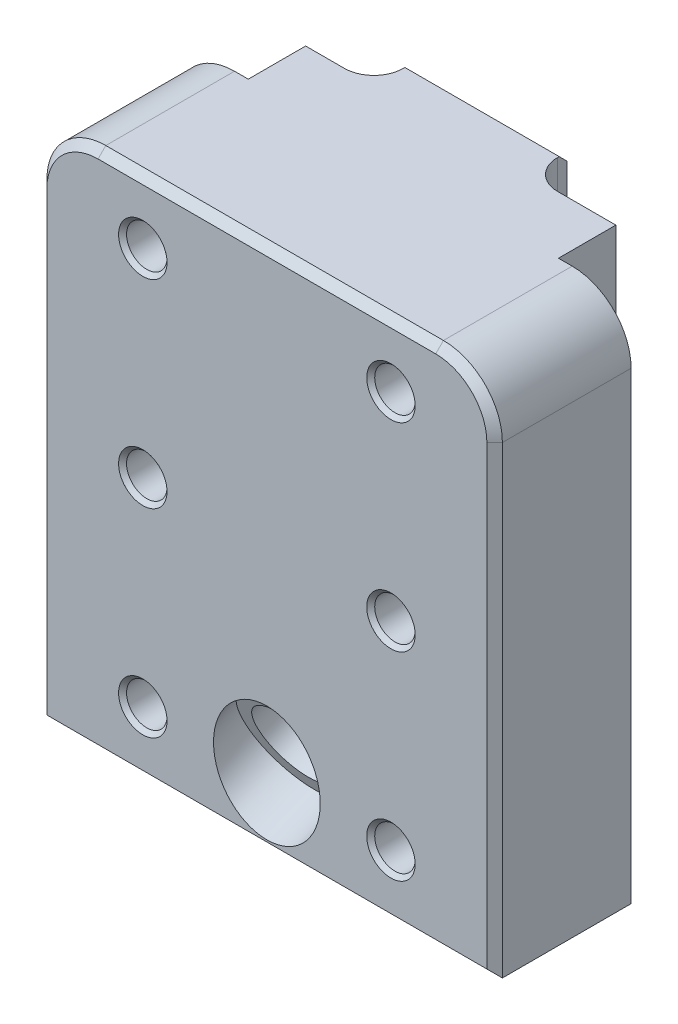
ISO-10303-21;
HEADER;
FILE_DESCRIPTION(('STEP AP214'),'2;1');
FILE_NAME('part.step','',(''),(''),'','','');
FILE_SCHEMA(('AUTOMOTIVE_DESIGN { 1 0 10303 214 1 1 1 1 }'));
ENDSEC;
DATA;
#1=APPLICATION_CONTEXT('core data for automotive mechanical design processes');
#2=APPLICATION_PROTOCOL_DEFINITION('international standard','automotive_design',2000,#1);
#3=PRODUCT_CONTEXT('',#1,'mechanical');
#4=PRODUCT('Part','Part','',(#3));
#5=PRODUCT_RELATED_PRODUCT_CATEGORY('part','',(#4));
#6=PRODUCT_DEFINITION_FORMATION('','',#4);
#7=PRODUCT_DEFINITION_CONTEXT('part definition',#1,'design');
#8=PRODUCT_DEFINITION('design','',#6,#7);
#9=PRODUCT_DEFINITION_SHAPE('','',#8);
#10=(LENGTH_UNIT() NAMED_UNIT(*) SI_UNIT(.MILLI.,.METRE.));
#11=(NAMED_UNIT(*) PLANE_ANGLE_UNIT() SI_UNIT($,.RADIAN.));
#12=(NAMED_UNIT(*) SI_UNIT($,.STERADIAN.) SOLID_ANGLE_UNIT());
#13=UNCERTAINTY_MEASURE_WITH_UNIT(LENGTH_MEASURE(1.E-05),#10,'distance_accuracy_value','');
#14=(GEOMETRIC_REPRESENTATION_CONTEXT(3) GLOBAL_UNCERTAINTY_ASSIGNED_CONTEXT((#13)) GLOBAL_UNIT_ASSIGNED_CONTEXT((#10,
#11,#12)) REPRESENTATION_CONTEXT('',''));
#15=CARTESIAN_POINT('',(0.,0.,0.));
#16=DIRECTION('',(0.,0.,1.));
#17=DIRECTION('',(1.,0.,0.));
#18=AXIS2_PLACEMENT_3D('',#15,#16,#17);
#19=CARTESIAN_POINT('',(0.,85.598,22.352));
#20=DIRECTION('',(0.,0.,-1.));
#21=DIRECTION('',(-1.,0.,0.));
#22=AXIS2_PLACEMENT_3D('',#19,#20,#21);
#23=PLANE('',#22);
#24=DIRECTION('',(0.999999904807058,-0.000436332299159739,0.));
#25=VECTOR('',#24,1.);
#26=CARTESIAN_POINT('',(24.288749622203,42.7972683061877,22.352));
#27=LINE('',#26,#25);
#28=CARTESIAN_POINT('',(24.2890036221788,42.7972681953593,22.352));
#29=VERTEX_POINT('',#28);
#30=CARTESIAN_POINT('',(24.288749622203,42.7972683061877,22.352));
#31=VERTEX_POINT('',#30);
#32=EDGE_CURVE('E1704',#29,#31,#27,.F.);
#33=ORIENTED_EDGE('',*,*,#32,.F.);
#34=CARTESIAN_POINT('',(20.32,42.799,22.352));
#35=DIRECTION('',(0.,0.,1.));
#36=DIRECTION('',(1.,0.,0.));
#37=AXIS2_PLACEMENT_3D('',#34,#35,#36);
#38=CIRCLE('',#37,3.969004);
#39=CARTESIAN_POINT('',(24.289004,42.799,22.352));
#40=VERTEX_POINT('',#39);
#41=EDGE_CURVE('E1668',#40,#29,#38,.T.);
#42=ORIENTED_EDGE('',*,*,#41,.F.);
#43=DIRECTION('',(1.,0.,0.));
#44=VECTOR('',#43,1.);
#45=CARTESIAN_POINT('',(24.28875,42.799,22.352));
#46=LINE('',#45,#44);
#47=CARTESIAN_POINT('',(24.28875,42.799,22.352));
#48=VERTEX_POINT('',#47);
#49=EDGE_CURVE('E1696',#40,#48,#46,.F.);
#50=ORIENTED_EDGE('',*,*,#49,.T.);
#51=CARTESIAN_POINT('',(20.32,42.799,22.352));
#52=DIRECTION('',(0.,0.,-1.));
#53=DIRECTION('',(-1.,0.,0.));
#54=AXIS2_PLACEMENT_3D('',#51,#52,#53);
#55=CIRCLE('',#54,3.96875);
#56=EDGE_CURVE('E1708',#48,#31,#55,.T.);
#57=ORIENTED_EDGE('',*,*,#56,.T.);
#58=EDGE_LOOP('',(#33,#42,#50,#57));
#59=FACE_BOUND('',#58,.T.);
#60=DIRECTION('',(0.999999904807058,-0.000436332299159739,0.));
#61=VECTOR('',#60,1.);
#62=CARTESIAN_POINT('',(-16.351250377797,75.3092683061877,22.352));
#63=LINE('',#62,#61);
#64=CARTESIAN_POINT('',(-16.3509963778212,75.3092681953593,22.352));
#65=VERTEX_POINT('',#64);
#66=CARTESIAN_POINT('',(-16.351250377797,75.3092683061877,22.352));
#67=VERTEX_POINT('',#66);
#68=EDGE_CURVE('E1848',#65,#67,#63,.F.);
#69=ORIENTED_EDGE('',*,*,#68,.F.);
#70=CARTESIAN_POINT('',(-20.32,75.311,22.352));
#71=DIRECTION('',(0.,0.,1.));
#72=DIRECTION('',(1.,0.,0.));
#73=AXIS2_PLACEMENT_3D('',#70,#71,#72);
#74=CIRCLE('',#73,3.969004);
#75=CARTESIAN_POINT('',(-16.350996,75.311,22.352));
#76=VERTEX_POINT('',#75);
#77=EDGE_CURVE('E1797',#76,#65,#74,.T.);
#78=ORIENTED_EDGE('',*,*,#77,.F.);
#79=DIRECTION('',(1.,0.,0.));
#80=VECTOR('',#79,1.);
#81=CARTESIAN_POINT('',(-16.35125,75.311,22.352));
#82=LINE('',#81,#80);
#83=CARTESIAN_POINT('',(-16.35125,75.311,22.352));
#84=VERTEX_POINT('',#83);
#85=EDGE_CURVE('E1840',#76,#84,#82,.F.);
#86=ORIENTED_EDGE('',*,*,#85,.T.);
#87=CARTESIAN_POINT('',(-20.32,75.311,22.352));
#88=DIRECTION('',(0.,0.,-1.));
#89=DIRECTION('',(-1.,0.,0.));
#90=AXIS2_PLACEMENT_3D('',#87,#88,#89);
#91=CIRCLE('',#90,3.96875);
#92=EDGE_CURVE('E619',#84,#67,#91,.T.);
#93=ORIENTED_EDGE('',*,*,#92,.T.);
#94=EDGE_LOOP('',(#69,#78,#86,#93));
#95=FACE_BOUND('',#94,.T.);
#96=DIRECTION('',(0.999999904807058,-0.00043633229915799,0.));
#97=VECTOR('',#96,1.);
#98=CARTESIAN_POINT('',(-16.351250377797,10.2852683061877,22.352));
#99=LINE('',#98,#97);
#100=CARTESIAN_POINT('',(-16.3509963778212,10.2852681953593,22.352));
#101=VERTEX_POINT('',#100);
#102=CARTESIAN_POINT('',(-16.351250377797,10.2852683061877,22.352));
#103=VERTEX_POINT('',#102);
#104=EDGE_CURVE('E654',#101,#103,#99,.F.);
#105=ORIENTED_EDGE('',*,*,#104,.F.);
#106=CARTESIAN_POINT('',(-20.32,10.287,22.352));
#107=DIRECTION('',(0.,0.,1.));
#108=DIRECTION('',(1.,0.,0.));
#109=AXIS2_PLACEMENT_3D('',#106,#107,#108);
#110=CIRCLE('',#109,3.969004);
#111=CARTESIAN_POINT('',(-16.350996,10.287,22.352));
#112=VERTEX_POINT('',#111);
#113=EDGE_CURVE('E2150',#112,#101,#110,.T.);
#114=ORIENTED_EDGE('',*,*,#113,.F.);
#115=DIRECTION('',(1.,0.,0.));
#116=VECTOR('',#115,1.);
#117=CARTESIAN_POINT('',(-16.35125,10.287,22.352));
#118=LINE('',#117,#116);
#119=CARTESIAN_POINT('',(-16.35125,10.287,22.352));
#120=VERTEX_POINT('',#119);
#121=EDGE_CURVE('E658',#112,#120,#118,.F.);
#122=ORIENTED_EDGE('',*,*,#121,.T.);
#123=CARTESIAN_POINT('',(-20.32,10.287,22.352));
#124=DIRECTION('',(0.,0.,-1.));
#125=DIRECTION('',(-1.,0.,0.));
#126=AXIS2_PLACEMENT_3D('',#123,#124,#125);
#127=CIRCLE('',#126,3.96875);
#128=EDGE_CURVE('E635',#120,#103,#127,.T.);
#129=ORIENTED_EDGE('',*,*,#128,.T.);
#130=EDGE_LOOP('',(#105,#114,#122,#129));
#131=FACE_BOUND('',#130,.T.);
#132=DIRECTION('',(0.,-1.,0.));
#133=VECTOR('',#132,1.);
#134=CARTESIAN_POINT('',(-36.0299,0.,22.352));
#135=LINE('',#134,#133);
#136=CARTESIAN_POINT('',(-36.0299,75.946,22.352));
#137=VERTEX_POINT('',#136);
#138=CARTESIAN_POINT('',(-36.0299,1.27,22.352));
#139=VERTEX_POINT('',#138);
#140=EDGE_CURVE('E576',#137,#139,#135,.T.);
#141=ORIENTED_EDGE('',*,*,#140,.T.);
#142=DIRECTION('',(1.,0.,0.));
#143=VECTOR('',#142,1.);
#144=CARTESIAN_POINT('',(37.2999,1.27,22.352));
#145=LINE('',#144,#143);
#146=CARTESIAN_POINT('',(36.0299,1.27,22.352));
#147=VERTEX_POINT('',#146);
#148=EDGE_CURVE('E586',#139,#147,#145,.T.);
#149=ORIENTED_EDGE('',*,*,#148,.T.);
#150=DIRECTION('',(0.,1.,0.));
#151=VECTOR('',#150,1.);
#152=CARTESIAN_POINT('',(36.0299,85.598,22.352));
#153=LINE('',#152,#151);
#154=CARTESIAN_POINT('',(36.0299,75.946,22.352));
#155=VERTEX_POINT('',#154);
#156=EDGE_CURVE('E584',#147,#155,#153,.T.);
#157=ORIENTED_EDGE('',*,*,#156,.T.);
#158=CARTESIAN_POINT('',(27.6479,75.946,22.352));
#159=DIRECTION('',(0.,0.,-1.));
#160=DIRECTION('',(-1.,0.,0.));
#161=AXIS2_PLACEMENT_3D('',#158,#159,#160);
#162=CIRCLE('',#161,8.382);
#163=CARTESIAN_POINT('',(27.6479,84.328,22.352));
#164=VERTEX_POINT('',#163);
#165=EDGE_CURVE('E582',#155,#164,#162,.F.);
#166=ORIENTED_EDGE('',*,*,#165,.T.);
#167=DIRECTION('',(-1.,0.,0.));
#168=VECTOR('',#167,1.);
#169=CARTESIAN_POINT('',(0.,84.328,22.352));
#170=LINE('',#169,#168);
#171=CARTESIAN_POINT('',(-27.6479,84.328,22.352));
#172=VERTEX_POINT('',#171);
#173=EDGE_CURVE('E580',#164,#172,#170,.T.);
#174=ORIENTED_EDGE('',*,*,#173,.T.);
#175=CARTESIAN_POINT('',(-27.6479,75.946,22.352));
#176=DIRECTION('',(0.,0.,-1.));
#177=DIRECTION('',(-1.,0.,0.));
#178=AXIS2_PLACEMENT_3D('',#175,#176,#177);
#179=CIRCLE('',#178,8.382);
#180=EDGE_CURVE('E578',#172,#137,#179,.F.);
#181=ORIENTED_EDGE('',*,*,#180,.T.);
#182=EDGE_LOOP('',(#141,#149,#157,#166,#174,#181));
#183=FACE_BOUND('',#182,.T.);
#184=CARTESIAN_POINT('',(0.,11.0730822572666,22.352));
#185=DIRECTION('',(0.,0.,-1.));
#186=DIRECTION('',(0.,1.,0.));
#187=AXIS2_PLACEMENT_3D('',#184,#185,#186);
#188=ELLIPSE('',#187,9.49218243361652,8.7376);
#189=CARTESIAN_POINT('',(0.,20.5652646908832,22.352));
#190=VERTEX_POINT('',#189);
#191=EDGE_CURVE('E554',#190,#190,#188,.F.);
#192=ORIENTED_EDGE('',*,*,#191,.F.);
#193=EDGE_LOOP('',(#192));
#194=FACE_BOUND('',#193,.T.);
#195=DIRECTION('',(0.999999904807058,-0.00043633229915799,0.));
#196=VECTOR('',#195,1.);
#197=CARTESIAN_POINT('',(-16.351250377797,42.7972683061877,22.352));
#198=LINE('',#197,#196);
#199=CARTESIAN_POINT('',(-16.3509963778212,42.7972681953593,22.352));
#200=VERTEX_POINT('',#199);
#201=CARTESIAN_POINT('',(-16.351250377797,42.7972683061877,22.352));
#202=VERTEX_POINT('',#201);
#203=EDGE_CURVE('E2139',#200,#202,#198,.F.);
#204=ORIENTED_EDGE('',*,*,#203,.F.);
#205=CARTESIAN_POINT('',(-20.32,42.799,22.352));
#206=DIRECTION('',(0.,0.,1.));
#207=DIRECTION('',(1.,0.,0.));
#208=AXIS2_PLACEMENT_3D('',#205,#206,#207);
#209=CIRCLE('',#208,3.969004);
#210=CARTESIAN_POINT('',(-16.350996,42.799,22.352));
#211=VERTEX_POINT('',#210);
#212=EDGE_CURVE('E2248',#211,#200,#209,.T.);
#213=ORIENTED_EDGE('',*,*,#212,.F.);
#214=DIRECTION('',(1.,0.,0.));
#215=VECTOR('',#214,1.);
#216=CARTESIAN_POINT('',(-16.35125,42.799,22.352));
#217=LINE('',#216,#215);
#218=CARTESIAN_POINT('',(-16.35125,42.799,22.352));
#219=VERTEX_POINT('',#218);
#220=EDGE_CURVE('E2135',#211,#219,#217,.F.);
#221=ORIENTED_EDGE('',*,*,#220,.T.);
#222=CARTESIAN_POINT('',(-20.32,42.799,22.352));
#223=DIRECTION('',(0.,0.,-1.));
#224=DIRECTION('',(-1.,0.,0.));
#225=AXIS2_PLACEMENT_3D('',#222,#223,#224);
#226=CIRCLE('',#225,3.96875);
#227=EDGE_CURVE('E639',#219,#202,#226,.T.);
#228=ORIENTED_EDGE('',*,*,#227,.T.);
#229=EDGE_LOOP('',(#204,#213,#221,#228));
#230=FACE_BOUND('',#229,.T.);
#231=DIRECTION('',(0.999999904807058,-0.000436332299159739,0.));
#232=VECTOR('',#231,1.);
#233=CARTESIAN_POINT('',(24.288749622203,75.3092683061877,22.352));
#234=LINE('',#233,#232);
#235=CARTESIAN_POINT('',(24.2890036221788,75.3092681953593,22.352));
#236=VERTEX_POINT('',#235);
#237=CARTESIAN_POINT('',(24.288749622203,75.3092683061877,22.352));
#238=VERTEX_POINT('',#237);
#239=EDGE_CURVE('E1820',#236,#238,#234,.F.);
#240=ORIENTED_EDGE('',*,*,#239,.F.);
#241=CARTESIAN_POINT('',(20.32,75.311,22.352));
#242=DIRECTION('',(0.,0.,1.));
#243=DIRECTION('',(1.,0.,0.));
#244=AXIS2_PLACEMENT_3D('',#241,#242,#243);
#245=CIRCLE('',#244,3.969004);
#246=CARTESIAN_POINT('',(24.289004,75.311,22.352));
#247=VERTEX_POINT('',#246);
#248=EDGE_CURVE('E1763',#247,#236,#245,.T.);
#249=ORIENTED_EDGE('',*,*,#248,.F.);
#250=DIRECTION('',(1.,0.,0.));
#251=VECTOR('',#250,1.);
#252=CARTESIAN_POINT('',(24.28875,75.311,22.352));
#253=LINE('',#252,#251);
#254=CARTESIAN_POINT('',(24.28875,75.311,22.352));
#255=VERTEX_POINT('',#254);
#256=EDGE_CURVE('E1718',#247,#255,#253,.F.);
#257=ORIENTED_EDGE('',*,*,#256,.T.);
#258=CARTESIAN_POINT('',(20.32,75.311,22.352));
#259=DIRECTION('',(0.,0.,-1.));
#260=DIRECTION('',(-1.,0.,0.));
#261=AXIS2_PLACEMENT_3D('',#258,#259,#260);
#262=CIRCLE('',#261,3.96875);
#263=EDGE_CURVE('E624',#255,#238,#262,.T.);
#264=ORIENTED_EDGE('',*,*,#263,.T.);
#265=EDGE_LOOP('',(#240,#249,#257,#264));
#266=FACE_BOUND('',#265,.T.);
#267=DIRECTION('',(0.999999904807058,-0.000436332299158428,0.));
#268=VECTOR('',#267,1.);
#269=CARTESIAN_POINT('',(24.288749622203,10.2852683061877,22.352));
#270=LINE('',#269,#268);
#271=CARTESIAN_POINT('',(24.2890036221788,10.2852681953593,22.352));
#272=VERTEX_POINT('',#271);
#273=CARTESIAN_POINT('',(24.288749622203,10.2852683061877,22.352));
#274=VERTEX_POINT('',#273);
#275=EDGE_CURVE('E512',#272,#274,#270,.F.);
#276=ORIENTED_EDGE('',*,*,#275,.F.);
#277=CARTESIAN_POINT('',(20.32,10.287,22.352));
#278=DIRECTION('',(0.,0.,1.));
#279=DIRECTION('',(1.,0.,0.));
#280=AXIS2_PLACEMENT_3D('',#277,#278,#279);
#281=CIRCLE('',#280,3.969004);
#282=CARTESIAN_POINT('',(24.289004,10.287,22.352));
#283=VERTEX_POINT('',#282);
#284=EDGE_CURVE('E462',#283,#272,#281,.T.);
#285=ORIENTED_EDGE('',*,*,#284,.F.);
#286=DIRECTION('',(1.,0.,0.));
#287=VECTOR('',#286,1.);
#288=CARTESIAN_POINT('',(24.28875,10.287,22.352));
#289=LINE('',#288,#287);
#290=CARTESIAN_POINT('',(24.28875,10.287,22.352));
#291=VERTEX_POINT('',#290);
#292=EDGE_CURVE('E503',#283,#291,#289,.F.);
#293=ORIENTED_EDGE('',*,*,#292,.T.);
#294=CARTESIAN_POINT('',(20.32,10.287,22.352));
#295=DIRECTION('',(0.,0.,-1.));
#296=DIRECTION('',(-1.,0.,0.));
#297=AXIS2_PLACEMENT_3D('',#294,#295,#296);
#298=CIRCLE('',#297,3.96875);
#299=EDGE_CURVE('E638',#291,#274,#298,.T.);
#300=ORIENTED_EDGE('',*,*,#299,.T.);
#301=EDGE_LOOP('',(#276,#285,#293,#300));
#302=FACE_BOUND('',#301,.T.);
#303=ADVANCED_FACE('F17',(#59,#95,#131,#183,#194,#230,#266,#302),#23,.F.);
#304=CARTESIAN_POINT('',(-25.4,85.598,0.));
#305=DIRECTION('',(-1.,0.,0.));
#306=DIRECTION('',(0.,0.,1.));
#307=AXIS2_PLACEMENT_3D('',#304,#305,#306);
#308=PLANE('',#307);
#309=DIRECTION('',(0.,1.,0.));
#310=VECTOR('',#309,1.);
#311=CARTESIAN_POINT('',(-25.4,85.598,-9.398));
#312=LINE('',#311,#310);
#313=CARTESIAN_POINT('',(-25.4,38.6204802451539,-9.398));
#314=VERTEX_POINT('',#313);
#315=CARTESIAN_POINT('',(-25.4,85.598,-9.398));
#316=VERTEX_POINT('',#315);
#317=EDGE_CURVE('E418',#314,#316,#312,.T.);
#318=ORIENTED_EDGE('',*,*,#317,.F.);
#319=DIRECTION('',(0.,0.438371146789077,-0.898794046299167));
#320=VECTOR('',#319,1.);
#321=CARTESIAN_POINT('',(-25.4,43.9452530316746,-20.3154020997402));
#322=LINE('',#321,#320);
#323=CARTESIAN_POINT('',(-25.4,34.7325381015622,-1.4265372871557));
#324=VERTEX_POINT('',#323);
#325=EDGE_CURVE('E529',#324,#314,#322,.T.);
#326=ORIENTED_EDGE('',*,*,#325,.F.);
#327=CARTESIAN_POINT('',(-25.4,32.4496012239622,-2.53999999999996));
#328=DIRECTION('',(-1.,0.,0.));
#329=DIRECTION('',(0.,0.,1.));
#330=AXIS2_PLACEMENT_3D('',#327,#328,#329);
#331=CIRCLE('',#330,2.54);
#332=CARTESIAN_POINT('',(-25.4,32.4496012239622,0.));
#333=VERTEX_POINT('',#332);
#334=EDGE_CURVE('E612',#324,#333,#331,.F.);
#335=ORIENTED_EDGE('',*,*,#334,.T.);
#336=DIRECTION('',(0.,-1.,0.));
#337=VECTOR('',#336,1.);
#338=CARTESIAN_POINT('',(-25.4,85.598,0.));
#339=LINE('',#338,#337);
#340=CARTESIAN_POINT('',(-25.4,85.598,0.));
#341=VERTEX_POINT('',#340);
#342=EDGE_CURVE('E535',#341,#333,#339,.T.);
#343=ORIENTED_EDGE('',*,*,#342,.F.);
#344=DIRECTION('',(0.,0.,1.));
#345=VECTOR('',#344,1.);
#346=CARTESIAN_POINT('',(-25.4,85.598,0.));
#347=LINE('',#346,#345);
#348=EDGE_CURVE('E534',#316,#341,#347,.T.);
#349=ORIENTED_EDGE('',*,*,#348,.F.);
#350=EDGE_LOOP('',(#318,#326,#335,#343,#349));
#351=FACE_BOUND('',#350,.T.);
#352=ADVANCED_FACE('F531',(#351),#308,.T.);
#353=CARTESIAN_POINT('',(25.4,85.598,0.));
#354=DIRECTION('',(-1.,0.,0.));
#355=DIRECTION('',(0.,0.,1.));
#356=AXIS2_PLACEMENT_3D('',#353,#354,#355);
#357=PLANE('',#356);
#358=DIRECTION('',(0.,0.438371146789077,-0.898794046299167));
#359=VECTOR('',#358,1.);
#360=CARTESIAN_POINT('',(25.4,43.9452530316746,-20.3154020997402));
#361=LINE('',#360,#359);
#362=CARTESIAN_POINT('',(25.4,34.7325381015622,-1.42653728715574));
#363=VERTEX_POINT('',#362);
#364=CARTESIAN_POINT('',(25.4,38.6204802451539,-9.398));
#365=VERTEX_POINT('',#364);
#366=EDGE_CURVE('E707',#363,#365,#361,.T.);
#367=ORIENTED_EDGE('',*,*,#366,.T.);
#368=DIRECTION('',(0.,1.,0.));
#369=VECTOR('',#368,1.);
#370=CARTESIAN_POINT('',(25.4,85.598,-9.398));
#371=LINE('',#370,#369);
#372=CARTESIAN_POINT('',(25.4,85.598,-9.398));
#373=VERTEX_POINT('',#372);
#374=EDGE_CURVE('E453',#365,#373,#371,.T.);
#375=ORIENTED_EDGE('',*,*,#374,.T.);
#376=DIRECTION('',(0.,0.,1.));
#377=VECTOR('',#376,1.);
#378=CARTESIAN_POINT('',(25.4,85.598,0.));
#379=LINE('',#378,#377);
#380=CARTESIAN_POINT('',(25.4,85.598,0.));
#381=VERTEX_POINT('',#380);
#382=EDGE_CURVE('E538',#373,#381,#379,.T.);
#383=ORIENTED_EDGE('',*,*,#382,.T.);
#384=DIRECTION('',(0.,-1.,0.));
#385=VECTOR('',#384,1.);
#386=CARTESIAN_POINT('',(25.4,85.598,0.));
#387=LINE('',#386,#385);
#388=CARTESIAN_POINT('',(25.4,32.4496012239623,0.));
#389=VERTEX_POINT('',#388);
#390=EDGE_CURVE('E719',#381,#389,#387,.T.);
#391=ORIENTED_EDGE('',*,*,#390,.T.);
#392=CARTESIAN_POINT('',(25.4,32.4496012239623,-2.54));
#393=DIRECTION('',(-1.,0.,0.));
#394=DIRECTION('',(0.,0.,1.));
#395=AXIS2_PLACEMENT_3D('',#392,#393,#394);
#396=CIRCLE('',#395,2.54);
#397=EDGE_CURVE('E614',#389,#363,#396,.T.);
#398=ORIENTED_EDGE('',*,*,#397,.T.);
#399=EDGE_LOOP('',(#367,#375,#383,#391,#398));
#400=FACE_BOUND('',#399,.T.);
#401=ADVANCED_FACE('F800',(#400),#357,.F.);
#402=CARTESIAN_POINT('',(25.4,85.598,-15.748));
#403=DIRECTION('',(0.,0.,1.));
#404=DIRECTION('',(1.,0.,0.));
#405=AXIS2_PLACEMENT_3D('',#402,#403,#404);
#406=PLANE('',#405);
#407=DIRECTION('',(-1.,0.,0.));
#408=VECTOR('',#407,1.);
#409=CARTESIAN_POINT('',(25.4,42.3652821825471,-15.748));
#410=LINE('',#409,#408);
#411=CARTESIAN_POINT('',(11.049,42.3652821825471,-15.748));
#412=VERTEX_POINT('',#411);
#413=CARTESIAN_POINT('',(-14.224,42.3652821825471,-15.748));
#414=VERTEX_POINT('',#413);
#415=EDGE_CURVE('E603',#412,#414,#410,.T.);
#416=ORIENTED_EDGE('',*,*,#415,.T.);
#417=DIRECTION('',(0.,1.,0.));
#418=VECTOR('',#417,1.);
#419=CARTESIAN_POINT('',(-14.224,85.598,-15.748));
#420=LINE('',#419,#418);
#421=CARTESIAN_POINT('',(-14.224,84.328,-15.748));
#422=VERTEX_POINT('',#421);
#423=EDGE_CURVE('E32',#414,#422,#420,.T.);
#424=ORIENTED_EDGE('',*,*,#423,.T.);
#425=DIRECTION('',(1.,0.,0.));
#426=VECTOR('',#425,1.);
#427=CARTESIAN_POINT('',(25.4,84.328,-15.748));
#428=LINE('',#427,#426);
#429=CARTESIAN_POINT('',(11.049,84.328,-15.748));
#430=VERTEX_POINT('',#429);
#431=EDGE_CURVE('E601',#422,#430,#428,.T.);
#432=ORIENTED_EDGE('',*,*,#431,.T.);
#433=DIRECTION('',(0.,-1.,0.));
#434=VECTOR('',#433,1.);
#435=CARTESIAN_POINT('',(11.049,85.598,-15.748));
#436=LINE('',#435,#434);
#437=EDGE_CURVE('E448',#430,#412,#436,.T.);
#438=ORIENTED_EDGE('',*,*,#437,.T.);
#439=EDGE_LOOP('',(#416,#424,#432,#438));
#440=FACE_BOUND('',#439,.T.);
#441=ADVANCED_FACE('F813',(#440),#406,.F.);
#442=CARTESIAN_POINT('',(-37.2999,85.598,22.352));
#443=DIRECTION('',(0.,-1.,0.));
#444=DIRECTION('',(0.,0.,-1.));
#445=AXIS2_PLACEMENT_3D('',#442,#443,#444);
#446=PLANE('',#445);
#447=DIRECTION('',(-1.,0.,0.));
#448=VECTOR('',#447,1.);
#449=CARTESIAN_POINT('',(-37.2999,85.598,-14.478));
#450=LINE('',#449,#448);
#451=CARTESIAN_POINT('',(11.049,85.598,-14.478));
#452=VERTEX_POINT('',#451);
#453=CARTESIAN_POINT('',(-14.224,85.598,-14.478));
#454=VERTEX_POINT('',#453);
#455=EDGE_CURVE('E593',#452,#454,#450,.T.);
#456=ORIENTED_EDGE('',*,*,#455,.T.);
#457=DIRECTION('',(0.,0.,-1.));
#458=VECTOR('',#457,1.);
#459=CARTESIAN_POINT('',(-14.224,85.598,-23.4515109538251));
#460=LINE('',#459,#458);
#461=CARTESIAN_POINT('',(-14.224,85.598,-14.224));
#462=VERTEX_POINT('',#461);
#463=EDGE_CURVE('E412',#462,#454,#460,.T.);
#464=ORIENTED_EDGE('',*,*,#463,.F.);
#465=CARTESIAN_POINT('',(-19.05,85.598,-14.224));
#466=DIRECTION('',(0.,1.,0.));
#467=DIRECTION('',(0.,0.,-1.));
#468=AXIS2_PLACEMENT_3D('',#465,#466,#467);
#469=CIRCLE('',#468,4.826);
#470=CARTESIAN_POINT('',(-19.05,85.598,-9.398));
#471=VERTEX_POINT('',#470);
#472=EDGE_CURVE('E407',#471,#462,#469,.T.);
#473=ORIENTED_EDGE('',*,*,#472,.F.);
#474=DIRECTION('',(1.,0.,0.));
#475=VECTOR('',#474,1.);
#476=CARTESIAN_POINT('',(-19.05,85.598,-9.398));
#477=LINE('',#476,#475);
#478=EDGE_CURVE('E415',#316,#471,#477,.T.);
#479=ORIENTED_EDGE('',*,*,#478,.F.);
#480=ORIENTED_EDGE('',*,*,#348,.T.);
#481=DIRECTION('',(-1.,0.,0.));
#482=VECTOR('',#481,1.);
#483=CARTESIAN_POINT('',(37.2999,85.598,0.));
#484=LINE('',#483,#482);
#485=CARTESIAN_POINT('',(-27.6479,85.598,0.));
#486=VERTEX_POINT('',#485);
#487=EDGE_CURVE('E713',#341,#486,#484,.T.);
#488=ORIENTED_EDGE('',*,*,#487,.T.);
#489=DIRECTION('',(0.,0.,-1.));
#490=VECTOR('',#489,1.);
#491=CARTESIAN_POINT('',(-27.6479,85.598,22.352));
#492=LINE('',#491,#490);
#493=CARTESIAN_POINT('',(-27.6479,85.598,21.082));
#494=VERTEX_POINT('',#493);
#495=EDGE_CURVE('E567',#486,#494,#492,.F.);
#496=ORIENTED_EDGE('',*,*,#495,.T.);
#497=DIRECTION('',(1.,0.,0.));
#498=VECTOR('',#497,1.);
#499=CARTESIAN_POINT('',(-37.2999,85.598,21.082));
#500=LINE('',#499,#498);
#501=CARTESIAN_POINT('',(27.6479,85.598,21.082));
#502=VERTEX_POINT('',#501);
#503=EDGE_CURVE('E595',#494,#502,#500,.T.);
#504=ORIENTED_EDGE('',*,*,#503,.T.);
#505=DIRECTION('',(0.,0.,-1.));
#506=VECTOR('',#505,1.);
#507=CARTESIAN_POINT('',(27.6479,85.598,22.352));
#508=LINE('',#507,#506);
#509=CARTESIAN_POINT('',(27.6479,85.598,0.));
#510=VERTEX_POINT('',#509);
#511=EDGE_CURVE('E570',#502,#510,#508,.T.);
#512=ORIENTED_EDGE('',*,*,#511,.T.);
#513=EDGE_CURVE('E561',#510,#381,#484,.T.);
#514=ORIENTED_EDGE('',*,*,#513,.T.);
#515=ORIENTED_EDGE('',*,*,#382,.F.);
#516=DIRECTION('',(1.,0.,0.));
#517=VECTOR('',#516,1.);
#518=CARTESIAN_POINT('',(15.875,85.598,-9.398));
#519=LINE('',#518,#517);
#520=CARTESIAN_POINT('',(15.875,85.598,-9.398));
#521=VERTEX_POINT('',#520);
#522=EDGE_CURVE('E437',#521,#373,#519,.T.);
#523=ORIENTED_EDGE('',*,*,#522,.F.);
#524=CARTESIAN_POINT('',(15.875,85.598,-14.224));
#525=DIRECTION('',(0.,1.,0.));
#526=DIRECTION('',(0.,0.,-1.));
#527=AXIS2_PLACEMENT_3D('',#524,#525,#526);
#528=CIRCLE('',#527,4.826);
#529=CARTESIAN_POINT('',(11.049,85.598,-14.224));
#530=VERTEX_POINT('',#529);
#531=EDGE_CURVE('E434',#530,#521,#528,.T.);
#532=ORIENTED_EDGE('',*,*,#531,.F.);
#533=DIRECTION('',(0.,0.,1.));
#534=VECTOR('',#533,1.);
#535=CARTESIAN_POINT('',(11.049,85.598,-14.224));
#536=LINE('',#535,#534);
#537=EDGE_CURVE('E439',#452,#530,#536,.T.);
#538=ORIENTED_EDGE('',*,*,#537,.F.);
#539=EDGE_LOOP('',(#456,#464,#473,#479,#480,#488,#496,#504,#512,#514,#515,#523,#532,#538));
#540=FACE_BOUND('',#539,.T.);
#541=ADVANCED_FACE('F423',(#540),#446,.F.);
#542=CARTESIAN_POINT('',(-37.2999,0.,22.352));
#543=DIRECTION('',(0.,-1.,0.));
#544=DIRECTION('',(0.,0.,-1.));
#545=AXIS2_PLACEMENT_3D('',#542,#543,#544);
#546=PLANE('',#545);
#547=DIRECTION('',(0.,0.,-1.));
#548=VECTOR('',#547,1.);
#549=CARTESIAN_POINT('',(37.2999,0.,22.352));
#550=LINE('',#549,#548);
#551=CARTESIAN_POINT('',(37.2999,0.,21.082));
#552=VERTEX_POINT('',#551);
#553=CARTESIAN_POINT('',(37.2999,0.,0.));
#554=VERTEX_POINT('',#553);
#555=EDGE_CURVE('E559',#552,#554,#550,.T.);
#556=ORIENTED_EDGE('',*,*,#555,.F.);
#557=DIRECTION('',(-1.,0.,0.));
#558=VECTOR('',#557,1.);
#559=CARTESIAN_POINT('',(-37.2999,0.,21.082));
#560=LINE('',#559,#558);
#561=CARTESIAN_POINT('',(-37.2999,0.,21.082));
#562=VERTEX_POINT('',#561);
#563=EDGE_CURVE('E566',#552,#562,#560,.T.);
#564=ORIENTED_EDGE('',*,*,#563,.T.);
#565=DIRECTION('',(0.,0.,-1.));
#566=VECTOR('',#565,1.);
#567=CARTESIAN_POINT('',(-37.2999,0.,22.352));
#568=LINE('',#567,#566);
#569=CARTESIAN_POINT('',(-37.2999,0.,0.));
#570=VERTEX_POINT('',#569);
#571=EDGE_CURVE('E563',#562,#570,#568,.T.);
#572=ORIENTED_EDGE('',*,*,#571,.T.);
#573=DIRECTION('',(-1.,0.,0.));
#574=VECTOR('',#573,1.);
#575=CARTESIAN_POINT('',(37.2999,0.,0.));
#576=LINE('',#575,#574);
#577=EDGE_CURVE('E562',#554,#570,#576,.T.);
#578=ORIENTED_EDGE('',*,*,#577,.F.);
#579=EDGE_LOOP('',(#556,#564,#572,#578));
#580=FACE_BOUND('',#579,.T.);
#581=ADVANCED_FACE('F757',(#580),#546,.T.);
#582=CARTESIAN_POINT('',(-37.2999,85.598,22.352));
#583=DIRECTION('',(-1.,0.,0.));
#584=DIRECTION('',(0.,0.,1.));
#585=AXIS2_PLACEMENT_3D('',#582,#583,#584);
#586=PLANE('',#585);
#587=ORIENTED_EDGE('',*,*,#571,.F.);
#588=DIRECTION('',(0.,1.,0.));
#589=VECTOR('',#588,1.);
#590=CARTESIAN_POINT('',(-37.2999,75.946,21.082));
#591=LINE('',#590,#589);
#592=CARTESIAN_POINT('',(-37.2999,75.946,21.082));
#593=VERTEX_POINT('',#592);
#594=EDGE_CURVE('E599',#562,#593,#591,.T.);
#595=ORIENTED_EDGE('',*,*,#594,.T.);
#596=DIRECTION('',(0.,0.,-1.));
#597=VECTOR('',#596,1.);
#598=CARTESIAN_POINT('',(-37.2999,75.946,0.));
#599=LINE('',#598,#597);
#600=CARTESIAN_POINT('',(-37.2999,75.946,0.));
#601=VERTEX_POINT('',#600);
#602=EDGE_CURVE('E558',#593,#601,#599,.T.);
#603=ORIENTED_EDGE('',*,*,#602,.T.);
#604=DIRECTION('',(0.,-1.,0.));
#605=VECTOR('',#604,1.);
#606=CARTESIAN_POINT('',(-37.2999,85.598,0.));
#607=LINE('',#606,#605);
#608=EDGE_CURVE('E571',#601,#570,#607,.T.);
#609=ORIENTED_EDGE('',*,*,#608,.T.);
#610=EDGE_LOOP('',(#587,#595,#603,#609));
#611=FACE_BOUND('',#610,.T.);
#612=ADVANCED_FACE('F760',(#611),#586,.T.);
#613=CARTESIAN_POINT('',(37.2999,85.598,0.));
#614=DIRECTION('',(0.,0.,1.));
#615=DIRECTION('',(1.,0.,0.));
#616=AXIS2_PLACEMENT_3D('',#613,#614,#615);
#617=PLANE('',#616);
#618=ORIENTED_EDGE('',*,*,#342,.T.);
#619=DIRECTION('',(-1.,0.,0.));
#620=VECTOR('',#619,1.);
#621=CARTESIAN_POINT('',(25.4,32.4496012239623,0.));
#622=LINE('',#621,#620);
#623=EDGE_CURVE('E609',#333,#389,#622,.F.);
#624=ORIENTED_EDGE('',*,*,#623,.T.);
#625=ORIENTED_EDGE('',*,*,#390,.F.);
#626=ORIENTED_EDGE('',*,*,#513,.F.);
#627=CARTESIAN_POINT('',(27.6479,75.946,0.));
#628=DIRECTION('',(0.,0.,1.));
#629=DIRECTION('',(1.,0.,0.));
#630=AXIS2_PLACEMENT_3D('',#627,#628,#629);
#631=CIRCLE('',#630,9.652);
#632=CARTESIAN_POINT('',(37.2999,75.946,0.));
#633=VERTEX_POINT('',#632);
#634=EDGE_CURVE('E546',#510,#633,#631,.F.);
#635=ORIENTED_EDGE('',*,*,#634,.T.);
#636=DIRECTION('',(0.,-1.,0.));
#637=VECTOR('',#636,1.);
#638=CARTESIAN_POINT('',(37.2999,85.598,0.));
#639=LINE('',#638,#637);
#640=EDGE_CURVE('E715',#633,#554,#639,.T.);
#641=ORIENTED_EDGE('',*,*,#640,.T.);
#642=ORIENTED_EDGE('',*,*,#577,.T.);
#643=ORIENTED_EDGE('',*,*,#608,.F.);
#644=CARTESIAN_POINT('',(-27.6479,75.946,0.));
#645=DIRECTION('',(0.,0.,1.));
#646=DIRECTION('',(1.,0.,0.));
#647=AXIS2_PLACEMENT_3D('',#644,#645,#646);
#648=CIRCLE('',#647,9.652);
#649=EDGE_CURVE('E573',#601,#486,#648,.F.);
#650=ORIENTED_EDGE('',*,*,#649,.T.);
#651=ORIENTED_EDGE('',*,*,#487,.F.);
#652=EDGE_LOOP('',(#618,#624,#625,#626,#635,#641,#642,#643,#650,#651));
#653=FACE_BOUND('',#652,.T.);
#654=CARTESIAN_POINT('',(0.,20.5609433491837,0.));
#655=DIRECTION('',(0.,0.,1.));
#656=DIRECTION('',(0.,-1.,0.));
#657=AXIS2_PLACEMENT_3D('',#654,#655,#656);
#658=ELLIPSE('',#657,6.90528678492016,6.35635);
#659=CARTESIAN_POINT('',(0.,13.6556565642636,0.));
#660=VERTEX_POINT('',#659);
#661=EDGE_CURVE('E541',#660,#660,#658,.T.);
#662=ORIENTED_EDGE('',*,*,#661,.T.);
#663=EDGE_LOOP('',(#662));
#664=FACE_BOUND('',#663,.T.);
#665=ADVANCED_FACE('F732',(#653,#664),#617,.F.);
#666=CARTESIAN_POINT('',(37.2999,85.598,22.352));
#667=DIRECTION('',(-1.,0.,0.));
#668=DIRECTION('',(0.,0.,1.));
#669=AXIS2_PLACEMENT_3D('',#666,#667,#668);
#670=PLANE('',#669);
#671=DIRECTION('',(0.,0.,-1.));
#672=VECTOR('',#671,1.);
#673=CARTESIAN_POINT('',(37.2999,75.946,22.352));
#674=LINE('',#673,#672);
#675=CARTESIAN_POINT('',(37.2999,75.946,21.082));
#676=VERTEX_POINT('',#675);
#677=EDGE_CURVE('E555',#633,#676,#674,.F.);
#678=ORIENTED_EDGE('',*,*,#677,.T.);
#679=DIRECTION('',(0.,-1.,0.));
#680=VECTOR('',#679,1.);
#681=CARTESIAN_POINT('',(37.2999,85.598,21.082));
#682=LINE('',#681,#680);
#683=EDGE_CURVE('E589',#676,#552,#682,.T.);
#684=ORIENTED_EDGE('',*,*,#683,.T.);
#685=ORIENTED_EDGE('',*,*,#555,.T.);
#686=ORIENTED_EDGE('',*,*,#640,.F.);
#687=EDGE_LOOP('',(#678,#684,#685,#686));
#688=FACE_BOUND('',#687,.T.);
#689=ADVANCED_FACE('F741',(#688),#670,.F.);
#690=CARTESIAN_POINT('',(212.406685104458,34.036769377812,0.));
#691=DIRECTION('',(0.,0.898794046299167,0.438371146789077));
#692=DIRECTION('',(0.,-0.438371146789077,0.898794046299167));
#693=AXIS2_PLACEMENT_3D('',#690,#691,#692);
#694=PLANE('',#693);
#695=CARTESIAN_POINT('',(-19.05,40.9742777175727,-14.224));
#696=DIRECTION('',(0.,0.898794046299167,0.438371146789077));
#697=DIRECTION('',(0.,0.438371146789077,-0.898794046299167));
#698=AXIS2_PLACEMENT_3D('',#695,#696,#697);
#699=ELLIPSE('',#698,5.36941696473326,4.826);
#700=CARTESIAN_POINT('',(-19.05,38.6204802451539,-9.398));
#701=VERTEX_POINT('',#700);
#702=CARTESIAN_POINT('',(-14.224,40.9742777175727,-14.224));
#703=VERTEX_POINT('',#702);
#704=EDGE_CURVE('E10',#701,#703,#699,.T.);
#705=ORIENTED_EDGE('',*,*,#704,.T.);
#706=DIRECTION('',(0.,0.438371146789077,-0.898794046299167));
#707=VECTOR('',#706,1.);
#708=CARTESIAN_POINT('',(-14.224,34.036769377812,0.));
#709=LINE('',#708,#707);
#710=CARTESIAN_POINT('',(-14.224,41.1009034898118,-14.4836213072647));
#711=VERTEX_POINT('',#710);
#712=EDGE_CURVE('E427',#703,#711,#709,.T.);
#713=ORIENTED_EDGE('',*,*,#712,.T.);
#714=DIRECTION('',(1.,0.,0.));
#715=VECTOR('',#714,1.);
#716=CARTESIAN_POINT('',(212.406685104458,41.1009034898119,-14.4836213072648));
#717=LINE('',#716,#715);
#718=CARTESIAN_POINT('',(11.049,41.1009034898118,-14.4836213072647));
#719=VERTEX_POINT('',#718);
#720=EDGE_CURVE('E40',#711,#719,#717,.T.);
#721=ORIENTED_EDGE('',*,*,#720,.T.);
#722=DIRECTION('',(0.,-0.438371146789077,0.898794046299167));
#723=VECTOR('',#722,1.);
#724=CARTESIAN_POINT('',(11.049,34.036769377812,0.));
#725=LINE('',#724,#723);
#726=CARTESIAN_POINT('',(11.049,40.9742777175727,-14.224));
#727=VERTEX_POINT('',#726);
#728=EDGE_CURVE('E445',#719,#727,#725,.T.);
#729=ORIENTED_EDGE('',*,*,#728,.T.);
#730=CARTESIAN_POINT('',(15.875,40.9742777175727,-14.224));
#731=DIRECTION('',(0.,0.898794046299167,0.438371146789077));
#732=DIRECTION('',(0.,0.438371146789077,-0.898794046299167));
#733=AXIS2_PLACEMENT_3D('',#730,#731,#732);
#734=ELLIPSE('',#733,5.36941696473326,4.826);
#735=CARTESIAN_POINT('',(15.875,38.6204802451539,-9.398));
#736=VERTEX_POINT('',#735);
#737=EDGE_CURVE('E521',#727,#736,#734,.T.);
#738=ORIENTED_EDGE('',*,*,#737,.T.);
#739=DIRECTION('',(1.,0.,0.));
#740=VECTOR('',#739,1.);
#741=CARTESIAN_POINT('',(212.406685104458,38.6204802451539,-9.398));
#742=LINE('',#741,#740);
#743=EDGE_CURVE('E517',#736,#365,#742,.T.);
#744=ORIENTED_EDGE('',*,*,#743,.T.);
#745=ORIENTED_EDGE('',*,*,#366,.F.);
#746=DIRECTION('',(-1.,0.,0.));
#747=VECTOR('',#746,1.);
#748=CARTESIAN_POINT('',(-25.4,34.7325381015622,-1.4265372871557));
#749=LINE('',#748,#747);
#750=EDGE_CURVE('E607',#363,#324,#749,.T.);
#751=ORIENTED_EDGE('',*,*,#750,.T.);
#752=ORIENTED_EDGE('',*,*,#325,.T.);
#753=DIRECTION('',(1.,0.,0.));
#754=VECTOR('',#753,1.);
#755=CARTESIAN_POINT('',(212.406685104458,38.6204802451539,-9.398));
#756=LINE('',#755,#754);
#757=EDGE_CURVE('E25',#314,#701,#756,.T.);
#758=ORIENTED_EDGE('',*,*,#757,.T.);
#759=EDGE_LOOP('',(#705,#713,#721,#729,#738,#744,#745,#751,#752,#758));
#760=FACE_BOUND('',#759,.T.);
#761=ADVANCED_FACE('F526',(#760),#694,.F.);
#762=CARTESIAN_POINT('',(0.,2.46498981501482,42.6313949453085));
#763=DIRECTION('',(0.,0.390731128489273,-0.92050485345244));
#764=DIRECTION('',(0.,0.92050485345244,0.390731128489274));
#765=AXIS2_PLACEMENT_3D('',#762,#763,#764);
#766=CYLINDRICAL_SURFACE('',#765,8.7376);
#767=CARTESIAN_POINT('',(0.,12.9087147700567,18.0275208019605));
#768=DIRECTION('',(0.,-0.390731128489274,0.920504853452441));
#769=DIRECTION('',(0.,-0.92050485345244,-0.390731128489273));
#770=AXIS2_PLACEMENT_3D('',#767,#768,#769);
#771=CIRCLE('',#770,8.7376);
#772=CARTESIAN_POINT('',(0.,4.86571156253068,14.6134684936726));
#773=VERTEX_POINT('',#772);
#774=EDGE_CURVE('E550',#773,#773,#771,.T.);
#775=ORIENTED_EDGE('',*,*,#774,.F.);
#776=EDGE_LOOP('',(#775));
#777=FACE_BOUND('',#776,.T.);
#778=ORIENTED_EDGE('',*,*,#191,.T.);
#779=EDGE_LOOP('',(#778));
#780=FACE_BOUND('',#779,.T.);
#781=ADVANCED_FACE('F827',(#777,#780),#766,.F.);
#782=CARTESIAN_POINT('',(0.,12.9087147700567,18.0275208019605));
#783=DIRECTION('',(0.,-0.390731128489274,0.920504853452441));
#784=DIRECTION('',(0.,-0.92050485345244,-0.390731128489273));
#785=AXIS2_PLACEMENT_3D('',#782,#783,#784);
#786=PLANE('',#785);
#787=CARTESIAN_POINT('',(0.,12.9087147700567,18.0275208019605));
#788=DIRECTION('',(0.,-0.390731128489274,0.920504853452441));
#789=DIRECTION('',(0.,-0.92050485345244,-0.390731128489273));
#790=AXIS2_PLACEMENT_3D('',#787,#788,#789);
#791=CIRCLE('',#790,6.35635);
#792=CARTESIAN_POINT('',(0.,7.05766374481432,15.5438969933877));
#793=VERTEX_POINT('',#792);
#794=EDGE_CURVE('E537',#793,#793,#791,.T.);
#795=ORIENTED_EDGE('',*,*,#794,.F.);
#796=EDGE_LOOP('',(#795));
#797=FACE_BOUND('',#796,.T.);
#798=ORIENTED_EDGE('',*,*,#774,.T.);
#799=EDGE_LOOP('',(#798));
#800=FACE_BOUND('',#799,.T.);
#801=ADVANCED_FACE('F823',(#797,#800),#786,.T.);
#802=CARTESIAN_POINT('',(0.,22.31413114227,-4.13025161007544));
#803=DIRECTION('',(0.,-0.390731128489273,0.92050485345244));
#804=DIRECTION('',(0.,-0.92050485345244,-0.390731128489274));
#805=AXIS2_PLACEMENT_3D('',#802,#803,#804);
#806=CYLINDRICAL_SURFACE('',#805,6.35635);
#807=ORIENTED_EDGE('',*,*,#794,.T.);
#808=EDGE_LOOP('',(#807));
#809=FACE_BOUND('',#808,.T.);
#810=ORIENTED_EDGE('',*,*,#661,.F.);
#811=EDGE_LOOP('',(#810));
#812=FACE_BOUND('',#811,.T.);
#813=ADVANCED_FACE('F820',(#809,#812),#806,.F.);
#814=CARTESIAN_POINT('',(27.6479,75.946,22.352));
#815=DIRECTION('',(0.,0.,-1.));
#816=DIRECTION('',(-1.,0.,0.));
#817=AXIS2_PLACEMENT_3D('',#814,#815,#816);
#818=CYLINDRICAL_SURFACE('',#817,9.652);
#819=ORIENTED_EDGE('',*,*,#511,.F.);
#820=CARTESIAN_POINT('',(27.6479,75.946,21.082));
#821=DIRECTION('',(0.,0.,-1.));
#822=DIRECTION('',(-1.,0.,0.));
#823=AXIS2_PLACEMENT_3D('',#820,#821,#822);
#824=CIRCLE('',#823,9.652);
#825=EDGE_CURVE('E591',#502,#676,#824,.T.);
#826=ORIENTED_EDGE('',*,*,#825,.T.);
#827=ORIENTED_EDGE('',*,*,#677,.F.);
#828=ORIENTED_EDGE('',*,*,#634,.F.);
#829=EDGE_LOOP('',(#819,#826,#827,#828));
#830=FACE_BOUND('',#829,.T.);
#831=ADVANCED_FACE('F744',(#830),#818,.T.);
#832=CARTESIAN_POINT('',(-27.6479,75.946,22.352));
#833=DIRECTION('',(0.,0.,1.));
#834=DIRECTION('',(1.,0.,0.));
#835=AXIS2_PLACEMENT_3D('',#832,#833,#834);
#836=CYLINDRICAL_SURFACE('',#835,9.652);
#837=ORIENTED_EDGE('',*,*,#602,.F.);
#838=CARTESIAN_POINT('',(-27.6479,75.946,21.082));
#839=DIRECTION('',(0.,0.,-1.));
#840=DIRECTION('',(-1.,0.,0.));
#841=AXIS2_PLACEMENT_3D('',#838,#839,#840);
#842=CIRCLE('',#841,9.652);
#843=EDGE_CURVE('E597',#593,#494,#842,.T.);
#844=ORIENTED_EDGE('',*,*,#843,.T.);
#845=ORIENTED_EDGE('',*,*,#495,.F.);
#846=ORIENTED_EDGE('',*,*,#649,.F.);
#847=EDGE_LOOP('',(#837,#844,#845,#846));
#848=FACE_BOUND('',#847,.T.);
#849=ADVANCED_FACE('F765',(#848),#836,.T.);
#850=CARTESIAN_POINT('',(-20.32,10.287,5.1816));
#851=DIRECTION('',(0.,0.,1.));
#852=DIRECTION('',(1.,0.,0.));
#853=AXIS2_PLACEMENT_3D('',#850,#851,#852);
#854=CYLINDRICAL_SURFACE('',#853,3.3147);
#855=CARTESIAN_POINT('',(-20.32,10.287,21.69795));
#856=DIRECTION('',(0.,0.,-1.));
#857=DIRECTION('',(-1.,0.,0.));
#858=AXIS2_PLACEMENT_3D('',#855,#856,#857);
#859=CIRCLE('',#858,3.3147);
#860=CARTESIAN_POINT('',(-23.6347,10.287,21.69795));
#861=VERTEX_POINT('',#860);
#862=EDGE_CURVE('E627',#861,#861,#859,.F.);
#863=ORIENTED_EDGE('',*,*,#862,.T.);
#864=EDGE_LOOP('',(#863));
#865=FACE_BOUND('',#864,.T.);
#866=CARTESIAN_POINT('',(-20.32,10.287,5.207));
#867=DIRECTION('',(0.,0.,-1.));
#868=DIRECTION('',(-1.,0.,0.));
#869=AXIS2_PLACEMENT_3D('',#866,#867,#868);
#870=CIRCLE('',#869,3.3147);
#871=CARTESIAN_POINT('',(-23.6347,10.287,5.207));
#872=VERTEX_POINT('',#871);
#873=EDGE_CURVE('E699',#872,#872,#870,.T.);
#874=ORIENTED_EDGE('',*,*,#873,.T.);
#875=EDGE_LOOP('',(#874));
#876=FACE_BOUND('',#875,.T.);
#877=ADVANCED_FACE('F829',(#865,#876),#854,.F.);
#878=CARTESIAN_POINT('',(-20.32,42.799,5.1816));
#879=DIRECTION('',(0.,0.,1.));
#880=DIRECTION('',(1.,0.,0.));
#881=AXIS2_PLACEMENT_3D('',#878,#879,#880);
#882=CYLINDRICAL_SURFACE('',#881,3.3147);
#883=CARTESIAN_POINT('',(-20.32,42.799,21.69795));
#884=DIRECTION('',(0.,0.,-1.));
#885=DIRECTION('',(-1.,0.,0.));
#886=AXIS2_PLACEMENT_3D('',#883,#884,#885);
#887=CIRCLE('',#886,3.3147);
#888=CARTESIAN_POINT('',(-23.6347,42.799,21.69795));
#889=VERTEX_POINT('',#888);
#890=EDGE_CURVE('E630',#889,#889,#887,.F.);
#891=ORIENTED_EDGE('',*,*,#890,.T.);
#892=EDGE_LOOP('',(#891));
#893=FACE_BOUND('',#892,.T.);
#894=CARTESIAN_POINT('',(-20.32,42.799,5.207));
#895=DIRECTION('',(0.,0.,-1.));
#896=DIRECTION('',(-1.,0.,0.));
#897=AXIS2_PLACEMENT_3D('',#894,#895,#896);
#898=CIRCLE('',#897,3.3147);
#899=CARTESIAN_POINT('',(-23.6347,42.799,5.207));
#900=VERTEX_POINT('',#899);
#901=EDGE_CURVE('E702',#900,#900,#898,.T.);
#902=ORIENTED_EDGE('',*,*,#901,.T.);
#903=EDGE_LOOP('',(#902));
#904=FACE_BOUND('',#903,.T.);
#905=ADVANCED_FACE('F832',(#893,#904),#882,.F.);
#906=CARTESIAN_POINT('',(20.32,42.799,5.1816));
#907=DIRECTION('',(0.,0.,1.));
#908=DIRECTION('',(1.,0.,0.));
#909=AXIS2_PLACEMENT_3D('',#906,#907,#908);
#910=CYLINDRICAL_SURFACE('',#909,3.3147);
#911=CARTESIAN_POINT('',(20.32,42.799,21.69795));
#912=DIRECTION('',(0.,0.,-1.));
#913=DIRECTION('',(-1.,0.,0.));
#914=AXIS2_PLACEMENT_3D('',#911,#912,#913);
#915=CIRCLE('',#914,3.3147);
#916=CARTESIAN_POINT('',(17.0053,42.799,21.69795));
#917=VERTEX_POINT('',#916);
#918=EDGE_CURVE('E620',#917,#917,#915,.F.);
#919=ORIENTED_EDGE('',*,*,#918,.T.);
#920=EDGE_LOOP('',(#919));
#921=FACE_BOUND('',#920,.T.);
#922=CARTESIAN_POINT('',(20.32,42.799,5.207));
#923=DIRECTION('',(0.,0.,-1.));
#924=DIRECTION('',(-1.,0.,0.));
#925=AXIS2_PLACEMENT_3D('',#922,#923,#924);
#926=CIRCLE('',#925,3.3147);
#927=CARTESIAN_POINT('',(17.0053,42.799,5.207));
#928=VERTEX_POINT('',#927);
#929=EDGE_CURVE('E693',#928,#928,#926,.T.);
#930=ORIENTED_EDGE('',*,*,#929,.T.);
#931=EDGE_LOOP('',(#930));
#932=FACE_BOUND('',#931,.T.);
#933=ADVANCED_FACE('F836',(#921,#932),#910,.F.);
#934=CARTESIAN_POINT('',(20.32,75.311,5.1816));
#935=DIRECTION('',(0.,0.,1.));
#936=DIRECTION('',(1.,0.,0.));
#937=AXIS2_PLACEMENT_3D('',#934,#935,#936);
#938=CYLINDRICAL_SURFACE('',#937,3.3147);
#939=CARTESIAN_POINT('',(20.32,75.311,21.69795));
#940=DIRECTION('',(0.,0.,-1.));
#941=DIRECTION('',(-1.,0.,0.));
#942=AXIS2_PLACEMENT_3D('',#939,#940,#941);
#943=CIRCLE('',#942,3.3147);
#944=CARTESIAN_POINT('',(17.0053,75.311,21.69795));
#945=VERTEX_POINT('',#944);
#946=EDGE_CURVE('E616',#945,#945,#943,.F.);
#947=ORIENTED_EDGE('',*,*,#946,.T.);
#948=EDGE_LOOP('',(#947));
#949=FACE_BOUND('',#948,.T.);
#950=CARTESIAN_POINT('',(20.32,75.311,5.207));
#951=DIRECTION('',(0.,0.,-1.));
#952=DIRECTION('',(-1.,0.,0.));
#953=AXIS2_PLACEMENT_3D('',#950,#951,#952);
#954=CIRCLE('',#953,3.3147);
#955=CARTESIAN_POINT('',(17.0053,75.311,5.207));
#956=VERTEX_POINT('',#955);
#957=EDGE_CURVE('E696',#956,#956,#954,.T.);
#958=ORIENTED_EDGE('',*,*,#957,.T.);
#959=EDGE_LOOP('',(#958));
#960=FACE_BOUND('',#959,.T.);
#961=ADVANCED_FACE('F843',(#949,#960),#938,.F.);
#962=CARTESIAN_POINT('',(20.32,10.287,5.1816));
#963=DIRECTION('',(0.,0.,1.));
#964=DIRECTION('',(1.,0.,0.));
#965=AXIS2_PLACEMENT_3D('',#962,#963,#964);
#966=CYLINDRICAL_SURFACE('',#965,3.3147);
#967=CARTESIAN_POINT('',(20.32,10.287,21.69795));
#968=DIRECTION('',(0.,0.,-1.));
#969=DIRECTION('',(-1.,0.,0.));
#970=AXIS2_PLACEMENT_3D('',#967,#968,#969);
#971=CIRCLE('',#970,3.3147);
#972=CARTESIAN_POINT('',(17.0053,10.287,21.69795));
#973=VERTEX_POINT('',#972);
#974=EDGE_CURVE('E623',#973,#973,#971,.F.);
#975=ORIENTED_EDGE('',*,*,#974,.T.);
#976=EDGE_LOOP('',(#975));
#977=FACE_BOUND('',#976,.T.);
#978=CARTESIAN_POINT('',(20.32,10.287,5.207));
#979=DIRECTION('',(0.,0.,-1.));
#980=DIRECTION('',(-1.,0.,0.));
#981=AXIS2_PLACEMENT_3D('',#978,#979,#980);
#982=CIRCLE('',#981,3.3147);
#983=CARTESIAN_POINT('',(17.0053,10.287,5.207));
#984=VERTEX_POINT('',#983);
#985=EDGE_CURVE('E690',#984,#984,#982,.T.);
#986=ORIENTED_EDGE('',*,*,#985,.T.);
#987=EDGE_LOOP('',(#986));
#988=FACE_BOUND('',#987,.T.);
#989=ADVANCED_FACE('F19',(#977,#988),#966,.F.);
#990=CARTESIAN_POINT('',(-20.32,75.311,5.1816));
#991=DIRECTION('',(0.,0.,1.));
#992=DIRECTION('',(1.,0.,0.));
#993=AXIS2_PLACEMENT_3D('',#990,#991,#992);
#994=CYLINDRICAL_SURFACE('',#993,3.3147);
#995=CARTESIAN_POINT('',(-20.32,75.311,21.69795));
#996=DIRECTION('',(0.,0.,-1.));
#997=DIRECTION('',(-1.,0.,0.));
#998=AXIS2_PLACEMENT_3D('',#995,#996,#997);
#999=CIRCLE('',#998,3.3147);
#1000=CARTESIAN_POINT('',(-23.6347,75.311,21.69795));
#1001=VERTEX_POINT('',#1000);
#1002=EDGE_CURVE('E518',#1001,#1001,#999,.F.);
#1003=ORIENTED_EDGE('',*,*,#1002,.T.);
#1004=EDGE_LOOP('',(#1003));
#1005=FACE_BOUND('',#1004,.T.);
#1006=CARTESIAN_POINT('',(-20.32,75.311,5.207));
#1007=DIRECTION('',(0.,0.,-1.));
#1008=DIRECTION('',(-1.,0.,0.));
#1009=AXIS2_PLACEMENT_3D('',#1006,#1007,#1008);
#1010=CIRCLE('',#1009,3.3147);
#1011=CARTESIAN_POINT('',(-23.6347,75.311,5.207));
#1012=VERTEX_POINT('',#1011);
#1013=EDGE_CURVE('E543',#1012,#1012,#1010,.T.);
#1014=ORIENTED_EDGE('',*,*,#1013,.T.);
#1015=EDGE_LOOP('',(#1014));
#1016=FACE_BOUND('',#1015,.T.);
#1017=ADVANCED_FACE('F838',(#1005,#1016),#994,.F.);
#1018=CARTESIAN_POINT('',(-20.32,75.311,5.207));
#1019=DIRECTION('',(0.,0.,1.));
#1020=DIRECTION('',(1.,0.,0.));
#1021=AXIS2_PLACEMENT_3D('',#1018,#1019,#1020);
#1022=CONICAL_SURFACE('',#1021,3.3147,1.02974425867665);
#1023=ORIENTED_EDGE('',*,*,#1013,.F.);
#1024=EDGE_LOOP('',(#1023));
#1025=FACE_BOUND('',#1024,.T.);
#1026=CARTESIAN_POINT('',(-20.32,75.311,3.21532730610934));
#1027=VERTEX_POINT('',#1026);
#1028=VERTEX_LOOP('',#1027);
#1029=FACE_BOUND('',#1028,.T.);
#1030=ADVANCED_FACE('F841',(#1025,#1029),#1022,.F.);
#1031=CARTESIAN_POINT('',(-20.32,42.799,5.207));
#1032=DIRECTION('',(0.,0.,1.));
#1033=DIRECTION('',(1.,0.,0.));
#1034=AXIS2_PLACEMENT_3D('',#1031,#1032,#1033);
#1035=CONICAL_SURFACE('',#1034,3.3147,1.02974425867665);
#1036=ORIENTED_EDGE('',*,*,#901,.F.);
#1037=EDGE_LOOP('',(#1036));
#1038=FACE_BOUND('',#1037,.T.);
#1039=CARTESIAN_POINT('',(-20.32,42.799,3.21532730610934));
#1040=VERTEX_POINT('',#1039);
#1041=VERTEX_LOOP('',#1040);
#1042=FACE_BOUND('',#1041,.T.);
#1043=ADVANCED_FACE('F873',(#1038,#1042),#1035,.F.);
#1044=CARTESIAN_POINT('',(-20.32,10.287,5.207));
#1045=DIRECTION('',(0.,0.,1.));
#1046=DIRECTION('',(1.,0.,0.));
#1047=AXIS2_PLACEMENT_3D('',#1044,#1045,#1046);
#1048=CONICAL_SURFACE('',#1047,3.3147,1.02974425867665);
#1049=ORIENTED_EDGE('',*,*,#873,.F.);
#1050=EDGE_LOOP('',(#1049));
#1051=FACE_BOUND('',#1050,.T.);
#1052=CARTESIAN_POINT('',(-20.32,10.287,3.21532730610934));
#1053=VERTEX_POINT('',#1052);
#1054=VERTEX_LOOP('',#1053);
#1055=FACE_BOUND('',#1054,.T.);
#1056=ADVANCED_FACE('F866',(#1051,#1055),#1048,.F.);
#1057=CARTESIAN_POINT('',(20.32,75.311,5.207));
#1058=DIRECTION('',(0.,0.,1.));
#1059=DIRECTION('',(1.,0.,0.));
#1060=AXIS2_PLACEMENT_3D('',#1057,#1058,#1059);
#1061=CONICAL_SURFACE('',#1060,3.3147,1.02974425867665);
#1062=ORIENTED_EDGE('',*,*,#957,.F.);
#1063=EDGE_LOOP('',(#1062));
#1064=FACE_BOUND('',#1063,.T.);
#1065=CARTESIAN_POINT('',(20.32,75.311,3.21532730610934));
#1066=VERTEX_POINT('',#1065);
#1067=VERTEX_LOOP('',#1066);
#1068=FACE_BOUND('',#1067,.T.);
#1069=ADVANCED_FACE('F858',(#1064,#1068),#1061,.F.);
#1070=CARTESIAN_POINT('',(20.32,42.799,5.207));
#1071=DIRECTION('',(0.,0.,1.));
#1072=DIRECTION('',(1.,0.,0.));
#1073=AXIS2_PLACEMENT_3D('',#1070,#1071,#1072);
#1074=CONICAL_SURFACE('',#1073,3.3147,1.02974425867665);
#1075=ORIENTED_EDGE('',*,*,#929,.F.);
#1076=EDGE_LOOP('',(#1075));
#1077=FACE_BOUND('',#1076,.T.);
#1078=CARTESIAN_POINT('',(20.32,42.799,3.21532730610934));
#1079=VERTEX_POINT('',#1078);
#1080=VERTEX_LOOP('',#1079);
#1081=FACE_BOUND('',#1080,.T.);
#1082=ADVANCED_FACE('F854',(#1077,#1081),#1074,.F.);
#1083=CARTESIAN_POINT('',(20.32,10.287,5.207));
#1084=DIRECTION('',(0.,0.,1.));
#1085=DIRECTION('',(1.,0.,0.));
#1086=AXIS2_PLACEMENT_3D('',#1083,#1084,#1085);
#1087=CONICAL_SURFACE('',#1086,3.3147,1.02974425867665);
#1088=ORIENTED_EDGE('',*,*,#985,.F.);
#1089=EDGE_LOOP('',(#1088));
#1090=FACE_BOUND('',#1089,.T.);
#1091=CARTESIAN_POINT('',(20.32,10.287,3.21532730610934));
#1092=VERTEX_POINT('',#1091);
#1093=VERTEX_LOOP('',#1092);
#1094=FACE_BOUND('',#1093,.T.);
#1095=ADVANCED_FACE('F857',(#1090,#1094),#1087,.F.);
#1096=CARTESIAN_POINT('',(0.,84.328,22.352));
#1097=DIRECTION('',(0.,-0.707106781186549,-0.707106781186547));
#1098=DIRECTION('',(0.,0.707106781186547,-0.707106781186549));
#1099=AXIS2_PLACEMENT_3D('',#1096,#1097,#1098);
#1100=PLANE('',#1099);
#1101=DIRECTION('',(0.,0.707106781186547,-0.707106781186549));
#1102=VECTOR('',#1101,1.);
#1103=CARTESIAN_POINT('',(-27.6479,84.328,22.352));
#1104=LINE('',#1103,#1102);
#1105=EDGE_CURVE('E684',#172,#494,#1104,.T.);
#1106=ORIENTED_EDGE('',*,*,#1105,.F.);
#1107=ORIENTED_EDGE('',*,*,#173,.F.);
#1108=DIRECTION('',(0.,-0.707106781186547,0.707106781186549));
#1109=VECTOR('',#1108,1.);
#1110=CARTESIAN_POINT('',(27.6479,85.598,21.082));
#1111=LINE('',#1110,#1109);
#1112=EDGE_CURVE('E687',#502,#164,#1111,.T.);
#1113=ORIENTED_EDGE('',*,*,#1112,.F.);
#1114=ORIENTED_EDGE('',*,*,#503,.F.);
#1115=EDGE_LOOP('',(#1106,#1107,#1113,#1114));
#1116=FACE_BOUND('',#1115,.T.);
#1117=ADVANCED_FACE('F769',(#1116),#1100,.F.);
#1118=CARTESIAN_POINT('',(27.6479,75.946,22.352));
#1119=DIRECTION('',(0.,0.,-1.));
#1120=DIRECTION('',(-1.,0.,0.));
#1121=AXIS2_PLACEMENT_3D('',#1118,#1119,#1120);
#1122=CONICAL_SURFACE('',#1121,8.382,0.785398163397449);
#1123=ORIENTED_EDGE('',*,*,#1112,.T.);
#1124=ORIENTED_EDGE('',*,*,#165,.F.);
#1125=DIRECTION('',(-0.707106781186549,0.,0.707106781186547));
#1126=VECTOR('',#1125,1.);
#1127=CARTESIAN_POINT('',(37.2999,75.946,21.082));
#1128=LINE('',#1127,#1126);
#1129=EDGE_CURVE('E681',#676,#155,#1128,.T.);
#1130=ORIENTED_EDGE('',*,*,#1129,.F.);
#1131=ORIENTED_EDGE('',*,*,#825,.F.);
#1132=EDGE_LOOP('',(#1123,#1124,#1130,#1131));
#1133=FACE_BOUND('',#1132,.T.);
#1134=ADVANCED_FACE('F748',(#1133),#1122,.T.);
#1135=CARTESIAN_POINT('',(-27.6479,75.946,21.082));
#1136=DIRECTION('',(0.,0.,-1.));
#1137=DIRECTION('',(-1.,0.,0.));
#1138=AXIS2_PLACEMENT_3D('',#1135,#1136,#1137);
#1139=CONICAL_SURFACE('',#1138,9.652,0.785398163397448);
#1140=ORIENTED_EDGE('',*,*,#1105,.T.);
#1141=ORIENTED_EDGE('',*,*,#843,.F.);
#1142=DIRECTION('',(-0.707106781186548,0.,-0.707106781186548));
#1143=VECTOR('',#1142,1.);
#1144=CARTESIAN_POINT('',(-36.0299,75.946,22.352));
#1145=LINE('',#1144,#1143);
#1146=EDGE_CURVE('E678',#137,#593,#1145,.T.);
#1147=ORIENTED_EDGE('',*,*,#1146,.F.);
#1148=ORIENTED_EDGE('',*,*,#180,.F.);
#1149=EDGE_LOOP('',(#1140,#1141,#1147,#1148));
#1150=FACE_BOUND('',#1149,.T.);
#1151=ADVANCED_FACE('F773',(#1150),#1139,.T.);
#1152=CARTESIAN_POINT('',(36.0299,85.598,22.352));
#1153=DIRECTION('',(-0.707106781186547,0.,-0.707106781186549));
#1154=DIRECTION('',(-0.707106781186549,0.,0.707106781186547));
#1155=AXIS2_PLACEMENT_3D('',#1152,#1153,#1154);
#1156=PLANE('',#1155);
#1157=ORIENTED_EDGE('',*,*,#1129,.T.);
#1158=ORIENTED_EDGE('',*,*,#156,.F.);
#1159=DIRECTION('',(-0.577350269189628,0.577350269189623,0.577350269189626));
#1160=VECTOR('',#1159,1.);
#1161=CARTESIAN_POINT('',(7.92056666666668,29.3793333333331,50.4613333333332));
#1162=LINE('',#1161,#1160);
#1163=EDGE_CURVE('E676',#552,#147,#1162,.T.);
#1164=ORIENTED_EDGE('',*,*,#1163,.F.);
#1165=ORIENTED_EDGE('',*,*,#683,.F.);
#1166=EDGE_LOOP('',(#1157,#1158,#1164,#1165));
#1167=FACE_BOUND('',#1166,.T.);
#1168=ADVANCED_FACE('F754',(#1167),#1156,.F.);
#1169=CARTESIAN_POINT('',(-37.2999,85.598,21.082));
#1170=DIRECTION('',(-0.707106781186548,0.,0.707106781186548));
#1171=DIRECTION('',(0.707106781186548,0.,0.707106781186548));
#1172=AXIS2_PLACEMENT_3D('',#1169,#1170,#1171);
#1173=PLANE('',#1172);
#1174=ORIENTED_EDGE('',*,*,#1146,.T.);
#1175=ORIENTED_EDGE('',*,*,#594,.F.);
#1176=DIRECTION('',(0.577350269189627,0.577350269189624,0.577350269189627));
#1177=VECTOR('',#1176,1.);
#1178=CARTESIAN_POINT('',(-8.76723333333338,28.5326666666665,49.6146666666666));
#1179=LINE('',#1178,#1177);
#1180=EDGE_CURVE('E657',#139,#562,#1179,.F.);
#1181=ORIENTED_EDGE('',*,*,#1180,.F.);
#1182=ORIENTED_EDGE('',*,*,#140,.F.);
#1183=EDGE_LOOP('',(#1174,#1175,#1181,#1182));
#1184=FACE_BOUND('',#1183,.T.);
#1185=ADVANCED_FACE('F783',(#1184),#1173,.T.);
#1186=CARTESIAN_POINT('',(-37.2999,0.,21.082));
#1187=DIRECTION('',(0.,-0.70710678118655,0.707106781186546));
#1188=DIRECTION('',(0.,-0.707106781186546,-0.70710678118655));
#1189=AXIS2_PLACEMENT_3D('',#1186,#1187,#1188);
#1190=PLANE('',#1189);
#1191=ORIENTED_EDGE('',*,*,#1163,.T.);
#1192=ORIENTED_EDGE('',*,*,#148,.F.);
#1193=ORIENTED_EDGE('',*,*,#1180,.T.);
#1194=ORIENTED_EDGE('',*,*,#563,.F.);
#1195=EDGE_LOOP('',(#1191,#1192,#1193,#1194));
#1196=FACE_BOUND('',#1195,.T.);
#1197=ADVANCED_FACE('F781',(#1196),#1190,.T.);
#1198=CARTESIAN_POINT('',(-37.2999,85.598,-14.478));
#1199=DIRECTION('',(0.,-0.70710678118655,0.707106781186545));
#1200=DIRECTION('',(0.,-0.707106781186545,-0.70710678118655));
#1201=AXIS2_PLACEMENT_3D('',#1198,#1199,#1200);
#1202=PLANE('',#1201);
#1203=DIRECTION('',(0.,0.707106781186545,0.70710678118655));
#1204=VECTOR('',#1203,1.);
#1205=CARTESIAN_POINT('',(-14.224,85.598,-14.478));
#1206=LINE('',#1205,#1204);
#1207=EDGE_CURVE('E431',#454,#422,#1206,.F.);
#1208=ORIENTED_EDGE('',*,*,#1207,.F.);
#1209=ORIENTED_EDGE('',*,*,#455,.F.);
#1210=DIRECTION('',(0.,-0.707106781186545,-0.70710678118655));
#1211=VECTOR('',#1210,1.);
#1212=CARTESIAN_POINT('',(11.049,85.598,-14.478));
#1213=LINE('',#1212,#1211);
#1214=EDGE_CURVE('E451',#430,#452,#1213,.F.);
#1215=ORIENTED_EDGE('',*,*,#1214,.F.);
#1216=ORIENTED_EDGE('',*,*,#431,.F.);
#1217=EDGE_LOOP('',(#1208,#1209,#1215,#1216));
#1218=FACE_BOUND('',#1217,.T.);
#1219=ADVANCED_FACE('F791',(#1218),#1202,.F.);
#1220=CARTESIAN_POINT('',(25.4,42.3652821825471,-15.748));
#1221=DIRECTION('',(0.,0.707106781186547,0.707106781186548));
#1222=DIRECTION('',(0.,-0.707106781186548,0.707106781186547));
#1223=AXIS2_PLACEMENT_3D('',#1220,#1221,#1222);
#1224=PLANE('',#1223);
#1225=DIRECTION('',(0.,0.707106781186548,-0.707106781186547));
#1226=VECTOR('',#1225,1.);
#1227=CARTESIAN_POINT('',(-14.224,42.3652821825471,-15.748));
#1228=LINE('',#1227,#1226);
#1229=EDGE_CURVE('E524',#414,#711,#1228,.F.);
#1230=ORIENTED_EDGE('',*,*,#1229,.F.);
#1231=ORIENTED_EDGE('',*,*,#415,.F.);
#1232=DIRECTION('',(0.,-0.707106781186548,0.707106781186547));
#1233=VECTOR('',#1232,1.);
#1234=CARTESIAN_POINT('',(11.049,42.3652821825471,-15.748));
#1235=LINE('',#1234,#1233);
#1236=EDGE_CURVE('E515',#719,#412,#1235,.F.);
#1237=ORIENTED_EDGE('',*,*,#1236,.F.);
#1238=ORIENTED_EDGE('',*,*,#720,.F.);
#1239=EDGE_LOOP('',(#1230,#1231,#1237,#1238));
#1240=FACE_BOUND('',#1239,.T.);
#1241=ADVANCED_FACE('F962',(#1240),#1224,.F.);
#1242=CARTESIAN_POINT('',(212.406685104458,32.4496012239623,-2.54000000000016));
#1243=DIRECTION('',(1.,0.,0.));
#1244=DIRECTION('',(0.,0.,-1.));
#1245=AXIS2_PLACEMENT_3D('',#1242,#1243,#1244);
#1246=CYLINDRICAL_SURFACE('',#1245,2.54);
#1247=ORIENTED_EDGE('',*,*,#397,.F.);
#1248=ORIENTED_EDGE('',*,*,#623,.F.);
#1249=ORIENTED_EDGE('',*,*,#334,.F.);
#1250=ORIENTED_EDGE('',*,*,#750,.F.);
#1251=EDGE_LOOP('',(#1247,#1248,#1249,#1250));
#1252=FACE_BOUND('',#1251,.T.);
#1253=ADVANCED_FACE('F972',(#1252),#1246,.F.);
#1254=CARTESIAN_POINT('',(20.32,75.311,21.69795));
#1255=DIRECTION('',(0.,0.,1.));
#1256=DIRECTION('',(1.,0.,0.));
#1257=AXIS2_PLACEMENT_3D('',#1254,#1255,#1256);
#1258=CONICAL_SURFACE('',#1257,3.3147,0.785398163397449);
#1259=ORIENTED_EDGE('',*,*,#263,.F.);
#1260=CARTESIAN_POINT('',(20.32,75.311,22.352));
#1261=DIRECTION('',(0.,0.,1.));
#1262=DIRECTION('',(1.,0.,0.));
#1263=AXIS2_PLACEMENT_3D('',#1260,#1261,#1262);
#1264=CIRCLE('',#1263,3.96875);
#1265=EDGE_CURVE('E1857',#255,#238,#1264,.T.);
#1266=ORIENTED_EDGE('',*,*,#1265,.T.);
#1267=EDGE_LOOP('',(#1259,#1266));
#1268=FACE_BOUND('',#1267,.T.);
#1269=ORIENTED_EDGE('',*,*,#946,.F.);
#1270=EDGE_LOOP('',(#1269));
#1271=FACE_BOUND('',#1270,.T.);
#1272=ADVANCED_FACE('F984',(#1268,#1271),#1258,.F.);
#1273=CARTESIAN_POINT('',(20.32,42.799,21.69795));
#1274=DIRECTION('',(0.,0.,1.));
#1275=DIRECTION('',(1.,0.,0.));
#1276=AXIS2_PLACEMENT_3D('',#1273,#1274,#1275);
#1277=CONICAL_SURFACE('',#1276,3.3147,0.785398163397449);
#1278=ORIENTED_EDGE('',*,*,#56,.F.);
#1279=CARTESIAN_POINT('',(20.32,42.799,22.352));
#1280=DIRECTION('',(0.,0.,1.));
#1281=DIRECTION('',(1.,0.,0.));
#1282=AXIS2_PLACEMENT_3D('',#1279,#1280,#1281);
#1283=CIRCLE('',#1282,3.96875);
#1284=EDGE_CURVE('E1726',#48,#31,#1283,.T.);
#1285=ORIENTED_EDGE('',*,*,#1284,.T.);
#1286=EDGE_LOOP('',(#1278,#1285));
#1287=FACE_BOUND('',#1286,.T.);
#1288=ORIENTED_EDGE('',*,*,#918,.F.);
#1289=EDGE_LOOP('',(#1288));
#1290=FACE_BOUND('',#1289,.T.);
#1291=ADVANCED_FACE('F996',(#1287,#1290),#1277,.F.);
#1292=CARTESIAN_POINT('',(20.32,10.287,21.69795));
#1293=DIRECTION('',(0.,0.,1.));
#1294=DIRECTION('',(1.,0.,0.));
#1295=AXIS2_PLACEMENT_3D('',#1292,#1293,#1294);
#1296=CONICAL_SURFACE('',#1295,3.3147,0.785398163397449);
#1297=ORIENTED_EDGE('',*,*,#299,.F.);
#1298=CARTESIAN_POINT('',(20.32,10.287,22.352));
#1299=DIRECTION('',(0.,0.,1.));
#1300=DIRECTION('',(1.,0.,0.));
#1301=AXIS2_PLACEMENT_3D('',#1298,#1299,#1300);
#1302=CIRCLE('',#1301,3.96875);
#1303=EDGE_CURVE('E1653',#291,#274,#1302,.T.);
#1304=ORIENTED_EDGE('',*,*,#1303,.T.);
#1305=EDGE_LOOP('',(#1297,#1304));
#1306=FACE_BOUND('',#1305,.T.);
#1307=ORIENTED_EDGE('',*,*,#974,.F.);
#1308=EDGE_LOOP('',(#1307));
#1309=FACE_BOUND('',#1308,.T.);
#1310=ADVANCED_FACE('F1007',(#1306,#1309),#1296,.F.);
#1311=CARTESIAN_POINT('',(-20.32,10.287,21.69795));
#1312=DIRECTION('',(0.,0.,1.));
#1313=DIRECTION('',(1.,0.,0.));
#1314=AXIS2_PLACEMENT_3D('',#1311,#1312,#1313);
#1315=CONICAL_SURFACE('',#1314,3.3147,0.785398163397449);
#1316=ORIENTED_EDGE('',*,*,#128,.F.);
#1317=CARTESIAN_POINT('',(-20.32,10.287,22.352));
#1318=DIRECTION('',(0.,0.,1.));
#1319=DIRECTION('',(1.,0.,0.));
#1320=AXIS2_PLACEMENT_3D('',#1317,#1318,#1319);
#1321=CIRCLE('',#1320,3.96875);
#1322=EDGE_CURVE('E645',#120,#103,#1321,.T.);
#1323=ORIENTED_EDGE('',*,*,#1322,.T.);
#1324=EDGE_LOOP('',(#1316,#1323));
#1325=FACE_BOUND('',#1324,.T.);
#1326=ORIENTED_EDGE('',*,*,#862,.F.);
#1327=EDGE_LOOP('',(#1326));
#1328=FACE_BOUND('',#1327,.T.);
#1329=ADVANCED_FACE('F1018',(#1325,#1328),#1315,.F.);
#1330=CARTESIAN_POINT('',(-20.32,42.799,21.69795));
#1331=DIRECTION('',(0.,0.,1.));
#1332=DIRECTION('',(1.,0.,0.));
#1333=AXIS2_PLACEMENT_3D('',#1330,#1331,#1332);
#1334=CONICAL_SURFACE('',#1333,3.3147,0.785398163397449);
#1335=ORIENTED_EDGE('',*,*,#227,.F.);
#1336=CARTESIAN_POINT('',(-20.32,42.799,22.352));
#1337=DIRECTION('',(0.,0.,1.));
#1338=DIRECTION('',(1.,0.,0.));
#1339=AXIS2_PLACEMENT_3D('',#1336,#1337,#1338);
#1340=CIRCLE('',#1339,3.96875);
#1341=EDGE_CURVE('E2216',#219,#202,#1340,.T.);
#1342=ORIENTED_EDGE('',*,*,#1341,.T.);
#1343=EDGE_LOOP('',(#1335,#1342));
#1344=FACE_BOUND('',#1343,.T.);
#1345=ORIENTED_EDGE('',*,*,#890,.F.);
#1346=EDGE_LOOP('',(#1345));
#1347=FACE_BOUND('',#1346,.T.);
#1348=ADVANCED_FACE('F1029',(#1344,#1347),#1334,.F.);
#1349=CARTESIAN_POINT('',(-20.32,75.311,21.69795));
#1350=DIRECTION('',(0.,0.,1.));
#1351=DIRECTION('',(1.,0.,0.));
#1352=AXIS2_PLACEMENT_3D('',#1349,#1350,#1351);
#1353=CONICAL_SURFACE('',#1352,3.3147,0.785398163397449);
#1354=ORIENTED_EDGE('',*,*,#92,.F.);
#1355=CARTESIAN_POINT('',(-20.32,75.311,22.352));
#1356=DIRECTION('',(0.,0.,1.));
#1357=DIRECTION('',(1.,0.,0.));
#1358=AXIS2_PLACEMENT_3D('',#1355,#1356,#1357);
#1359=CIRCLE('',#1358,3.96875);
#1360=EDGE_CURVE('E2117',#84,#67,#1359,.T.);
#1361=ORIENTED_EDGE('',*,*,#1360,.T.);
#1362=EDGE_LOOP('',(#1354,#1361));
#1363=FACE_BOUND('',#1362,.T.);
#1364=ORIENTED_EDGE('',*,*,#1002,.F.);
#1365=EDGE_LOOP('',(#1364));
#1366=FACE_BOUND('',#1365,.T.);
#1367=ADVANCED_FACE('F1040',(#1363,#1366),#1353,.F.);
#1368=CARTESIAN_POINT('',(-16.35125,10.287,7.112));
#1369=DIRECTION('',(0.,-1.,0.));
#1370=DIRECTION('',(-0.5,0.,-0.866025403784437));
#1371=AXIS2_PLACEMENT_3D('',#1368,#1369,#1370);
#1372=PLANE('',#1371);
#1373=DIRECTION('',(0.5,0.,0.866025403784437));
#1374=VECTOR('',#1373,1.);
#1375=CARTESIAN_POINT('',(-16.3510300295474,10.287,7.111873));
#1376=LINE('',#1375,#1374);
#1377=CARTESIAN_POINT('',(-16.350996,10.287,7.112));
#1378=VERTEX_POINT('',#1377);
#1379=CARTESIAN_POINT('',(-16.9923800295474,10.287,6.00102221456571));
#1380=VERTEX_POINT('',#1379);
#1381=EDGE_CURVE('E2149',#1378,#1380,#1376,.F.);
#1382=ORIENTED_EDGE('',*,*,#1381,.T.);
#1383=DIRECTION('',(0.866025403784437,0.,-0.5));
#1384=VECTOR('',#1383,1.);
#1385=CARTESIAN_POINT('',(-16.9926,10.287,6.00114921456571));
#1386=LINE('',#1385,#1384);
#1387=CARTESIAN_POINT('',(-16.9926,10.287,6.00114921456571));
#1388=VERTEX_POINT('',#1387);
#1389=EDGE_CURVE('E669',#1380,#1388,#1386,.F.);
#1390=ORIENTED_EDGE('',*,*,#1389,.T.);
#1391=DIRECTION('',(-0.5,0.,-0.866025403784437));
#1392=VECTOR('',#1391,1.);
#1393=CARTESIAN_POINT('',(-16.35125,10.287,7.112));
#1394=LINE('',#1393,#1392);
#1395=CARTESIAN_POINT('',(-16.35125,10.287,7.112));
#1396=VERTEX_POINT('',#1395);
#1397=EDGE_CURVE('E2177',#1396,#1388,#1394,.T.);
#1398=ORIENTED_EDGE('',*,*,#1397,.F.);
#1399=DIRECTION('',(0.,0.,-1.));
#1400=VECTOR('',#1399,1.);
#1401=CARTESIAN_POINT('',(-16.35125,10.287,22.352));
#1402=LINE('',#1401,#1400);
#1403=EDGE_CURVE('E651',#120,#1396,#1402,.T.);
#1404=ORIENTED_EDGE('',*,*,#1403,.F.);
#1405=ORIENTED_EDGE('',*,*,#121,.F.);
#1406=DIRECTION('',(0.,0.,1.));
#1407=VECTOR('',#1406,1.);
#1408=CARTESIAN_POINT('',(-16.350996,10.287,22.352));
#1409=LINE('',#1408,#1407);
#1410=EDGE_CURVE('E2153',#112,#1378,#1409,.F.);
#1411=ORIENTED_EDGE('',*,*,#1410,.T.);
#1412=EDGE_LOOP('',(#1382,#1390,#1398,#1404,#1405,#1411));
#1413=FACE_BOUND('',#1412,.T.);
#1414=ADVANCED_FACE('F1051',(#1413),#1372,.F.);
#1415=CARTESIAN_POINT('',(-20.32,10.287,6.00114921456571));
#1416=DIRECTION('',(0.,0.,-1.));
#1417=DIRECTION('',(-1.,0.,0.));
#1418=AXIS2_PLACEMENT_3D('',#1415,#1416,#1417);
#1419=CONICAL_SURFACE('',#1418,3.3274,1.0471975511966);
#1420=ORIENTED_EDGE('',*,*,#1389,.F.);
#1421=CARTESIAN_POINT('',(-20.32,10.287,6.00102221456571));
#1422=DIRECTION('',(0.,0.,1.));
#1423=DIRECTION('',(1.,0.,0.));
#1424=AXIS2_PLACEMENT_3D('',#1421,#1422,#1423);
#1425=CIRCLE('',#1424,3.32761997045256);
#1426=CARTESIAN_POINT('',(-16.9923803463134,10.2855480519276,6.00102221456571));
#1427=VERTEX_POINT('',#1426);
#1428=EDGE_CURVE('E646',#1380,#1427,#1425,.T.);
#1429=ORIENTED_EDGE('',*,*,#1428,.T.);
#1430=DIRECTION('',(0.866025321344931,-0.000377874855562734,-0.5));
#1431=VECTOR('',#1430,1.);
#1432=CARTESIAN_POINT('',(-16.992600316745,10.2855481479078,6.00114921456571));
#1433=LINE('',#1432,#1431);
#1434=CARTESIAN_POINT('',(-16.992600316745,10.2855481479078,6.00114921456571));
#1435=VERTEX_POINT('',#1434);
#1436=EDGE_CURVE('E2183',#1427,#1435,#1433,.F.);
#1437=ORIENTED_EDGE('',*,*,#1436,.T.);
#1438=CARTESIAN_POINT('',(-20.32,10.287,6.00114921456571));
#1439=DIRECTION('',(0.,0.,1.));
#1440=DIRECTION('',(1.,0.,0.));
#1441=AXIS2_PLACEMENT_3D('',#1438,#1439,#1440);
#1442=CIRCLE('',#1441,3.3274);
#1443=EDGE_CURVE('E2180',#1388,#1435,#1442,.T.);
#1444=ORIENTED_EDGE('',*,*,#1443,.F.);
#1445=EDGE_LOOP('',(#1420,#1429,#1437,#1444));
#1446=FACE_BOUND('',#1445,.T.);
#1447=ADVANCED_FACE('F1063',(#1446),#1419,.T.);
#1448=CARTESIAN_POINT('',(-16.351250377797,10.2852683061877,14.732));
#1449=DIRECTION('',(-0.00043633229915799,-0.999999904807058,0.));
#1450=DIRECTION('',(0.,0.,-1.));
#1451=AXIS2_PLACEMENT_3D('',#1448,#1449,#1450);
#1452=PLANE('',#1451);
#1453=DIRECTION('',(0.,0.,1.));
#1454=VECTOR('',#1453,1.);
#1455=CARTESIAN_POINT('',(-16.3509963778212,10.2852681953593,22.352));
#1456=LINE('',#1455,#1454);
#1457=CARTESIAN_POINT('',(-16.3509963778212,10.2852681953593,7.112));
#1458=VERTEX_POINT('',#1457);
#1459=EDGE_CURVE('E2154',#101,#1458,#1456,.F.);
#1460=ORIENTED_EDGE('',*,*,#1459,.F.);
#1461=ORIENTED_EDGE('',*,*,#104,.T.);
#1462=DIRECTION('',(0.,0.,-1.));
#1463=VECTOR('',#1462,1.);
#1464=CARTESIAN_POINT('',(-16.351250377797,10.2852683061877,22.352));
#1465=LINE('',#1464,#1463);
#1466=CARTESIAN_POINT('',(-16.351250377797,10.2852683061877,7.112));
#1467=VERTEX_POINT('',#1466);
#1468=EDGE_CURVE('E642',#103,#1467,#1465,.T.);
#1469=ORIENTED_EDGE('',*,*,#1468,.T.);
#1470=DIRECTION('',(-0.499999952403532,0.000218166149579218,-0.866025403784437));
#1471=VECTOR('',#1470,1.);
#1472=CARTESIAN_POINT('',(-16.351250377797,10.2852683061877,7.112));
#1473=LINE('',#1472,#1471);
#1474=EDGE_CURVE('E2175',#1467,#1435,#1473,.T.);
#1475=ORIENTED_EDGE('',*,*,#1474,.T.);
#1476=ORIENTED_EDGE('',*,*,#1436,.F.);
#1477=DIRECTION('',(0.499999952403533,-0.000218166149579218,0.866025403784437));
#1478=VECTOR('',#1477,1.);
#1479=CARTESIAN_POINT('',(-16.3510304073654,10.2852682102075,7.111873));
#1480=LINE('',#1479,#1478);
#1481=EDGE_CURVE('E2157',#1458,#1427,#1480,.F.);
#1482=ORIENTED_EDGE('',*,*,#1481,.F.);
#1483=EDGE_LOOP('',(#1460,#1461,#1469,#1475,#1476,#1482));
#1484=FACE_BOUND('',#1483,.T.);
#1485=ADVANCED_FACE('F1074',(#1484),#1452,.T.);
#1486=CARTESIAN_POINT('',(-20.32,10.287,7.112));
#1487=DIRECTION('',(0.,0.,1.));
#1488=DIRECTION('',(1.,0.,0.));
#1489=AXIS2_PLACEMENT_3D('',#1486,#1487,#1488);
#1490=CONICAL_SURFACE('',#1489,3.96875,0.5235987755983);
#1491=ORIENTED_EDGE('',*,*,#1474,.F.);
#1492=CARTESIAN_POINT('',(-20.32,10.287,7.112));
#1493=DIRECTION('',(0.,0.,1.));
#1494=DIRECTION('',(1.,0.,0.));
#1495=AXIS2_PLACEMENT_3D('',#1492,#1493,#1494);
#1496=CIRCLE('',#1495,3.96875);
#1497=EDGE_CURVE('E663',#1396,#1467,#1496,.T.);
#1498=ORIENTED_EDGE('',*,*,#1497,.F.);
#1499=ORIENTED_EDGE('',*,*,#1397,.T.);
#1500=ORIENTED_EDGE('',*,*,#1443,.T.);
#1501=EDGE_LOOP('',(#1491,#1498,#1499,#1500));
#1502=FACE_BOUND('',#1501,.T.);
#1503=ADVANCED_FACE('F1085',(#1502),#1490,.T.);
#1504=CARTESIAN_POINT('',(-20.32,10.287,22.352));
#1505=DIRECTION('',(0.,0.,1.));
#1506=DIRECTION('',(1.,0.,0.));
#1507=AXIS2_PLACEMENT_3D('',#1504,#1505,#1506);
#1508=CYLINDRICAL_SURFACE('',#1507,3.96875);
#1509=ORIENTED_EDGE('',*,*,#1468,.F.);
#1510=ORIENTED_EDGE('',*,*,#1322,.F.);
#1511=ORIENTED_EDGE('',*,*,#1403,.T.);
#1512=ORIENTED_EDGE('',*,*,#1497,.T.);
#1513=EDGE_LOOP('',(#1509,#1510,#1511,#1512));
#1514=FACE_BOUND('',#1513,.T.);
#1515=ADVANCED_FACE('F1095',(#1514),#1508,.T.);
#1516=CARTESIAN_POINT('',(-20.32,10.287,7.111873));
#1517=DIRECTION('',(0.,0.,1.));
#1518=DIRECTION('',(1.,0.,0.));
#1519=AXIS2_PLACEMENT_3D('',#1516,#1517,#1518);
#1520=CONICAL_SURFACE('',#1519,3.96896997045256,0.5235987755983);
#1521=ORIENTED_EDGE('',*,*,#1481,.T.);
#1522=ORIENTED_EDGE('',*,*,#1428,.F.);
#1523=ORIENTED_EDGE('',*,*,#1381,.F.);
#1524=CARTESIAN_POINT('',(-20.32,10.287,7.11193194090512));
#1525=DIRECTION('',(0.,0.,1.));
#1526=DIRECTION('',(1.,0.,0.));
#1527=AXIS2_PLACEMENT_3D('',#1524,#1525,#1526);
#1528=CIRCLE('',#1527,3.969004);
#1529=EDGE_CURVE('E2155',#1378,#1458,#1528,.T.);
#1530=ORIENTED_EDGE('',*,*,#1529,.T.);
#1531=EDGE_LOOP('',(#1521,#1522,#1523,#1530));
#1532=FACE_BOUND('',#1531,.T.);
#1533=ADVANCED_FACE('F1106',(#1532),#1520,.F.);
#1534=CARTESIAN_POINT('',(-20.32,10.287,22.352));
#1535=DIRECTION('',(0.,0.,1.));
#1536=DIRECTION('',(1.,0.,0.));
#1537=AXIS2_PLACEMENT_3D('',#1534,#1535,#1536);
#1538=CYLINDRICAL_SURFACE('',#1537,3.969004);
#1539=ORIENTED_EDGE('',*,*,#1459,.T.);
#1540=ORIENTED_EDGE('',*,*,#1529,.F.);
#1541=ORIENTED_EDGE('',*,*,#1410,.F.);
#1542=ORIENTED_EDGE('',*,*,#113,.T.);
#1543=EDGE_LOOP('',(#1539,#1540,#1541,#1542));
#1544=FACE_BOUND('',#1543,.T.);
#1545=ADVANCED_FACE('F1118',(#1544),#1538,.F.);
#1546=CARTESIAN_POINT('',(-16.35125,42.799,7.112));
#1547=DIRECTION('',(0.,-1.,0.));
#1548=DIRECTION('',(-0.5,0.,-0.866025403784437));
#1549=AXIS2_PLACEMENT_3D('',#1546,#1547,#1548);
#1550=PLANE('',#1549);
#1551=DIRECTION('',(0.5,0.,0.866025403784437));
#1552=VECTOR('',#1551,1.);
#1553=CARTESIAN_POINT('',(-16.3510300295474,42.799,7.111873));
#1554=LINE('',#1553,#1552);
#1555=CARTESIAN_POINT('',(-16.350996,42.799,7.112));
#1556=VERTEX_POINT('',#1555);
#1557=CARTESIAN_POINT('',(-16.9923800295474,42.799,6.00102221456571));
#1558=VERTEX_POINT('',#1557);
#1559=EDGE_CURVE('E2229',#1556,#1558,#1554,.F.);
#1560=ORIENTED_EDGE('',*,*,#1559,.T.);
#1561=DIRECTION('',(0.866025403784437,0.,-0.5));
#1562=VECTOR('',#1561,1.);
#1563=CARTESIAN_POINT('',(-16.9926,42.799,6.00114921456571));
#1564=LINE('',#1563,#1562);
#1565=CARTESIAN_POINT('',(-16.9926,42.799,6.00114921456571));
#1566=VERTEX_POINT('',#1565);
#1567=EDGE_CURVE('E2140',#1558,#1566,#1564,.F.);
#1568=ORIENTED_EDGE('',*,*,#1567,.T.);
#1569=DIRECTION('',(-0.5,0.,-0.866025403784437));
#1570=VECTOR('',#1569,1.);
#1571=CARTESIAN_POINT('',(-16.35125,42.799,7.112));
#1572=LINE('',#1571,#1570);
#1573=CARTESIAN_POINT('',(-16.35125,42.799,7.112));
#1574=VERTEX_POINT('',#1573);
#1575=EDGE_CURVE('E2256',#1574,#1566,#1572,.T.);
#1576=ORIENTED_EDGE('',*,*,#1575,.F.);
#1577=DIRECTION('',(0.,0.,-1.));
#1578=VECTOR('',#1577,1.);
#1579=CARTESIAN_POINT('',(-16.35125,42.799,22.352));
#1580=LINE('',#1579,#1578);
#1581=EDGE_CURVE('E2213',#219,#1574,#1580,.T.);
#1582=ORIENTED_EDGE('',*,*,#1581,.F.);
#1583=ORIENTED_EDGE('',*,*,#220,.F.);
#1584=DIRECTION('',(0.,0.,1.));
#1585=VECTOR('',#1584,1.);
#1586=CARTESIAN_POINT('',(-16.350996,42.799,22.352));
#1587=LINE('',#1586,#1585);
#1588=EDGE_CURVE('E2246',#211,#1556,#1587,.F.);
#1589=ORIENTED_EDGE('',*,*,#1588,.T.);
#1590=EDGE_LOOP('',(#1560,#1568,#1576,#1582,#1583,#1589));
#1591=FACE_BOUND('',#1590,.T.);
#1592=ADVANCED_FACE('F1129',(#1591),#1550,.F.);
#1593=CARTESIAN_POINT('',(-20.32,42.799,6.00114921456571));
#1594=DIRECTION('',(0.,0.,-1.));
#1595=DIRECTION('',(-1.,0.,0.));
#1596=AXIS2_PLACEMENT_3D('',#1593,#1594,#1595);
#1597=CONICAL_SURFACE('',#1596,3.3274,1.0471975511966);
#1598=ORIENTED_EDGE('',*,*,#1567,.F.);
#1599=CARTESIAN_POINT('',(-20.32,42.799,6.00102221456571));
#1600=DIRECTION('',(0.,0.,1.));
#1601=DIRECTION('',(1.,0.,0.));
#1602=AXIS2_PLACEMENT_3D('',#1599,#1600,#1601);
#1603=CIRCLE('',#1602,3.32761997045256);
#1604=CARTESIAN_POINT('',(-16.9923803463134,42.7975480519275,6.00102221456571));
#1605=VERTEX_POINT('',#1604);
#1606=EDGE_CURVE('E1843',#1558,#1605,#1603,.T.);
#1607=ORIENTED_EDGE('',*,*,#1606,.T.);
#1608=DIRECTION('',(0.86602532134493,-0.000377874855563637,-0.5));
#1609=VECTOR('',#1608,1.);
#1610=CARTESIAN_POINT('',(-16.992600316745,42.7975481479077,6.00114921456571));
#1611=LINE('',#1610,#1609);
#1612=CARTESIAN_POINT('',(-16.992600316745,42.7975481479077,6.00114921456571));
#1613=VERTEX_POINT('',#1612);
#1614=EDGE_CURVE('E2261',#1605,#1613,#1611,.F.);
#1615=ORIENTED_EDGE('',*,*,#1614,.T.);
#1616=CARTESIAN_POINT('',(-20.32,42.799,6.00114921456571));
#1617=DIRECTION('',(0.,0.,1.));
#1618=DIRECTION('',(1.,0.,0.));
#1619=AXIS2_PLACEMENT_3D('',#1616,#1617,#1618);
#1620=CIRCLE('',#1619,3.3274);
#1621=EDGE_CURVE('E2259',#1566,#1613,#1620,.T.);
#1622=ORIENTED_EDGE('',*,*,#1621,.F.);
#1623=EDGE_LOOP('',(#1598,#1607,#1615,#1622));
#1624=FACE_BOUND('',#1623,.T.);
#1625=ADVANCED_FACE('F1140',(#1624),#1597,.T.);
#1626=CARTESIAN_POINT('',(-16.351250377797,42.7972683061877,14.732));
#1627=DIRECTION('',(-0.00043633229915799,-0.999999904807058,0.));
#1628=DIRECTION('',(0.,0.,-1.));
#1629=AXIS2_PLACEMENT_3D('',#1626,#1627,#1628);
#1630=PLANE('',#1629);
#1631=DIRECTION('',(0.,0.,1.));
#1632=VECTOR('',#1631,1.);
#1633=CARTESIAN_POINT('',(-16.3509963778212,42.7972681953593,22.352));
#1634=LINE('',#1633,#1632);
#1635=CARTESIAN_POINT('',(-16.3509963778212,42.7972681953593,7.112));
#1636=VERTEX_POINT('',#1635);
#1637=EDGE_CURVE('E2122',#200,#1636,#1634,.F.);
#1638=ORIENTED_EDGE('',*,*,#1637,.F.);
#1639=ORIENTED_EDGE('',*,*,#203,.T.);
#1640=DIRECTION('',(0.,0.,-1.));
#1641=VECTOR('',#1640,1.);
#1642=CARTESIAN_POINT('',(-16.351250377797,42.7972683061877,22.352));
#1643=LINE('',#1642,#1641);
#1644=CARTESIAN_POINT('',(-16.351250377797,42.7972683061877,7.112));
#1645=VERTEX_POINT('',#1644);
#1646=EDGE_CURVE('E2220',#202,#1645,#1643,.T.);
#1647=ORIENTED_EDGE('',*,*,#1646,.T.);
#1648=DIRECTION('',(-0.499999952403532,0.000218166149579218,-0.866025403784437));
#1649=VECTOR('',#1648,1.);
#1650=CARTESIAN_POINT('',(-16.351250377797,42.7972683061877,7.112));
#1651=LINE('',#1650,#1649);
#1652=EDGE_CURVE('E2218',#1645,#1613,#1651,.T.);
#1653=ORIENTED_EDGE('',*,*,#1652,.T.);
#1654=ORIENTED_EDGE('',*,*,#1614,.F.);
#1655=DIRECTION('',(0.499999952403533,-0.000218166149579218,0.866025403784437));
#1656=VECTOR('',#1655,1.);
#1657=CARTESIAN_POINT('',(-16.3510304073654,42.7972682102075,7.111873));
#1658=LINE('',#1657,#1656);
#1659=EDGE_CURVE('E2234',#1636,#1605,#1658,.F.);
#1660=ORIENTED_EDGE('',*,*,#1659,.F.);
#1661=EDGE_LOOP('',(#1638,#1639,#1647,#1653,#1654,#1660));
#1662=FACE_BOUND('',#1661,.T.);
#1663=ADVANCED_FACE('F1151',(#1662),#1630,.T.);
#1664=CARTESIAN_POINT('',(-20.32,42.799,7.112));
#1665=DIRECTION('',(0.,0.,1.));
#1666=DIRECTION('',(1.,0.,0.));
#1667=AXIS2_PLACEMENT_3D('',#1664,#1665,#1666);
#1668=CONICAL_SURFACE('',#1667,3.96875,0.5235987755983);
#1669=ORIENTED_EDGE('',*,*,#1652,.F.);
#1670=CARTESIAN_POINT('',(-20.32,42.799,7.112));
#1671=DIRECTION('',(0.,0.,1.));
#1672=DIRECTION('',(1.,0.,0.));
#1673=AXIS2_PLACEMENT_3D('',#1670,#1671,#1672);
#1674=CIRCLE('',#1673,3.96875);
#1675=EDGE_CURVE('E2215',#1574,#1645,#1674,.T.);
#1676=ORIENTED_EDGE('',*,*,#1675,.F.);
#1677=ORIENTED_EDGE('',*,*,#1575,.T.);
#1678=ORIENTED_EDGE('',*,*,#1621,.T.);
#1679=EDGE_LOOP('',(#1669,#1676,#1677,#1678));
#1680=FACE_BOUND('',#1679,.T.);
#1681=ADVANCED_FACE('F1162',(#1680),#1668,.T.);
#1682=CARTESIAN_POINT('',(-20.32,42.799,22.352));
#1683=DIRECTION('',(0.,0.,1.));
#1684=DIRECTION('',(1.,0.,0.));
#1685=AXIS2_PLACEMENT_3D('',#1682,#1683,#1684);
#1686=CYLINDRICAL_SURFACE('',#1685,3.96875);
#1687=ORIENTED_EDGE('',*,*,#1646,.F.);
#1688=ORIENTED_EDGE('',*,*,#1341,.F.);
#1689=ORIENTED_EDGE('',*,*,#1581,.T.);
#1690=ORIENTED_EDGE('',*,*,#1675,.T.);
#1691=EDGE_LOOP('',(#1687,#1688,#1689,#1690));
#1692=FACE_BOUND('',#1691,.T.);
#1693=ADVANCED_FACE('F1172',(#1692),#1686,.T.);
#1694=CARTESIAN_POINT('',(-20.32,42.799,7.111873));
#1695=DIRECTION('',(0.,0.,1.));
#1696=DIRECTION('',(1.,0.,0.));
#1697=AXIS2_PLACEMENT_3D('',#1694,#1695,#1696);
#1698=CONICAL_SURFACE('',#1697,3.96896997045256,0.5235987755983);
#1699=ORIENTED_EDGE('',*,*,#1659,.T.);
#1700=ORIENTED_EDGE('',*,*,#1606,.F.);
#1701=ORIENTED_EDGE('',*,*,#1559,.F.);
#1702=CARTESIAN_POINT('',(-20.32,42.799,7.11193194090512));
#1703=DIRECTION('',(0.,0.,1.));
#1704=DIRECTION('',(1.,0.,0.));
#1705=AXIS2_PLACEMENT_3D('',#1702,#1703,#1704);
#1706=CIRCLE('',#1705,3.969004);
#1707=EDGE_CURVE('E2239',#1556,#1636,#1706,.T.);
#1708=ORIENTED_EDGE('',*,*,#1707,.T.);
#1709=EDGE_LOOP('',(#1699,#1700,#1701,#1708));
#1710=FACE_BOUND('',#1709,.T.);
#1711=ADVANCED_FACE('F1183',(#1710),#1698,.F.);
#1712=CARTESIAN_POINT('',(-20.32,42.799,22.352));
#1713=DIRECTION('',(0.,0.,1.));
#1714=DIRECTION('',(1.,0.,0.));
#1715=AXIS2_PLACEMENT_3D('',#1712,#1713,#1714);
#1716=CYLINDRICAL_SURFACE('',#1715,3.969004);
#1717=ORIENTED_EDGE('',*,*,#1637,.T.);
#1718=ORIENTED_EDGE('',*,*,#1707,.F.);
#1719=ORIENTED_EDGE('',*,*,#1588,.F.);
#1720=ORIENTED_EDGE('',*,*,#212,.T.);
#1721=EDGE_LOOP('',(#1717,#1718,#1719,#1720));
#1722=FACE_BOUND('',#1721,.T.);
#1723=ADVANCED_FACE('F1195',(#1722),#1716,.F.);
#1724=CARTESIAN_POINT('',(-16.35125,75.311,7.112));
#1725=DIRECTION('',(0.,-1.,0.));
#1726=DIRECTION('',(-0.5,0.,-0.866025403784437));
#1727=AXIS2_PLACEMENT_3D('',#1724,#1725,#1726);
#1728=PLANE('',#1727);
#1729=DIRECTION('',(0.5,0.,0.866025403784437));
#1730=VECTOR('',#1729,1.);
#1731=CARTESIAN_POINT('',(-16.3510300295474,75.311,7.111873));
#1732=LINE('',#1731,#1730);
#1733=CARTESIAN_POINT('',(-16.350996,75.311,7.112));
#1734=VERTEX_POINT('',#1733);
#1735=CARTESIAN_POINT('',(-16.9923800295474,75.311,6.00102221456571));
#1736=VERTEX_POINT('',#1735);
#1737=EDGE_CURVE('E1796',#1734,#1736,#1732,.F.);
#1738=ORIENTED_EDGE('',*,*,#1737,.T.);
#1739=DIRECTION('',(0.866025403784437,0.,-0.5));
#1740=VECTOR('',#1739,1.);
#1741=CARTESIAN_POINT('',(-16.9926,75.311,6.00114921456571));
#1742=LINE('',#1741,#1740);
#1743=CARTESIAN_POINT('',(-16.9926,75.311,6.00114921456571));
#1744=VERTEX_POINT('',#1743);
#1745=EDGE_CURVE('E1837',#1736,#1744,#1742,.F.);
#1746=ORIENTED_EDGE('',*,*,#1745,.T.);
#1747=DIRECTION('',(-0.5,0.,-0.866025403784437));
#1748=VECTOR('',#1747,1.);
#1749=CARTESIAN_POINT('',(-16.35125,75.311,7.112));
#1750=LINE('',#1749,#1748);
#1751=CARTESIAN_POINT('',(-16.35125,75.311,7.112));
#1752=VERTEX_POINT('',#1751);
#1753=EDGE_CURVE('E1825',#1752,#1744,#1750,.T.);
#1754=ORIENTED_EDGE('',*,*,#1753,.F.);
#1755=DIRECTION('',(0.,0.,-1.));
#1756=VECTOR('',#1755,1.);
#1757=CARTESIAN_POINT('',(-16.35125,75.311,22.352));
#1758=LINE('',#1757,#1756);
#1759=EDGE_CURVE('E1834',#84,#1752,#1758,.T.);
#1760=ORIENTED_EDGE('',*,*,#1759,.F.);
#1761=ORIENTED_EDGE('',*,*,#85,.F.);
#1762=DIRECTION('',(0.,0.,1.));
#1763=VECTOR('',#1762,1.);
#1764=CARTESIAN_POINT('',(-16.350996,75.311,22.352));
#1765=LINE('',#1764,#1763);
#1766=EDGE_CURVE('E1800',#76,#1734,#1765,.F.);
#1767=ORIENTED_EDGE('',*,*,#1766,.T.);
#1768=EDGE_LOOP('',(#1738,#1746,#1754,#1760,#1761,#1767));
#1769=FACE_BOUND('',#1768,.T.);
#1770=ADVANCED_FACE('F1206',(#1769),#1728,.F.);
#1771=CARTESIAN_POINT('',(-20.32,75.311,6.00114921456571));
#1772=DIRECTION('',(0.,0.,-1.));
#1773=DIRECTION('',(-1.,0.,0.));
#1774=AXIS2_PLACEMENT_3D('',#1771,#1772,#1773);
#1775=CONICAL_SURFACE('',#1774,3.3274,1.0471975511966);
#1776=ORIENTED_EDGE('',*,*,#1745,.F.);
#1777=CARTESIAN_POINT('',(-20.32,75.311,6.00102221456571));
#1778=DIRECTION('',(0.,0.,1.));
#1779=DIRECTION('',(1.,0.,0.));
#1780=AXIS2_PLACEMENT_3D('',#1777,#1778,#1779);
#1781=CIRCLE('',#1780,3.32761997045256);
#1782=CARTESIAN_POINT('',(-16.9923803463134,75.3095480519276,6.00102221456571));
#1783=VERTEX_POINT('',#1782);
#1784=EDGE_CURVE('E1792',#1736,#1783,#1781,.T.);
#1785=ORIENTED_EDGE('',*,*,#1784,.T.);
#1786=DIRECTION('',(0.86602532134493,-0.000377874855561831,-0.5));
#1787=VECTOR('',#1786,1.);
#1788=CARTESIAN_POINT('',(-16.992600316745,75.3095481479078,6.00114921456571));
#1789=LINE('',#1788,#1787);
#1790=CARTESIAN_POINT('',(-16.992600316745,75.3095481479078,6.00114921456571));
#1791=VERTEX_POINT('',#1790);
#1792=EDGE_CURVE('E1832',#1783,#1791,#1789,.F.);
#1793=ORIENTED_EDGE('',*,*,#1792,.T.);
#1794=CARTESIAN_POINT('',(-20.32,75.311,6.00114921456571));
#1795=DIRECTION('',(0.,0.,1.));
#1796=DIRECTION('',(1.,0.,0.));
#1797=AXIS2_PLACEMENT_3D('',#1794,#1795,#1796);
#1798=CIRCLE('',#1797,3.3274);
#1799=EDGE_CURVE('E1829',#1744,#1791,#1798,.T.);
#1800=ORIENTED_EDGE('',*,*,#1799,.F.);
#1801=EDGE_LOOP('',(#1776,#1785,#1793,#1800));
#1802=FACE_BOUND('',#1801,.T.);
#1803=ADVANCED_FACE('F1217',(#1802),#1775,.T.);
#1804=CARTESIAN_POINT('',(-16.351250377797,75.3092683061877,14.732));
#1805=DIRECTION('',(-0.000436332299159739,-0.999999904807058,0.));
#1806=DIRECTION('',(0.,0.,-1.));
#1807=AXIS2_PLACEMENT_3D('',#1804,#1805,#1806);
#1808=PLANE('',#1807);
#1809=DIRECTION('',(0.,0.,1.));
#1810=VECTOR('',#1809,1.);
#1811=CARTESIAN_POINT('',(-16.3509963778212,75.3092681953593,22.352));
#1812=LINE('',#1811,#1810);
#1813=CARTESIAN_POINT('',(-16.3509963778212,75.3092681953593,7.112));
#1814=VERTEX_POINT('',#1813);
#1815=EDGE_CURVE('E1801',#65,#1814,#1812,.F.);
#1816=ORIENTED_EDGE('',*,*,#1815,.F.);
#1817=ORIENTED_EDGE('',*,*,#68,.T.);
#1818=DIRECTION('',(0.,0.,-1.));
#1819=VECTOR('',#1818,1.);
#1820=CARTESIAN_POINT('',(-16.351250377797,75.3092683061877,22.352));
#1821=LINE('',#1820,#1819);
#1822=CARTESIAN_POINT('',(-16.351250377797,75.3092683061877,7.112));
#1823=VERTEX_POINT('',#1822);
#1824=EDGE_CURVE('E1795',#67,#1823,#1821,.T.);
#1825=ORIENTED_EDGE('',*,*,#1824,.T.);
#1826=DIRECTION('',(-0.499999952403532,0.000218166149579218,-0.866025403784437));
#1827=VECTOR('',#1826,1.);
#1828=CARTESIAN_POINT('',(-16.351250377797,75.3092683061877,7.112));
#1829=LINE('',#1828,#1827);
#1830=EDGE_CURVE('E1823',#1823,#1791,#1829,.T.);
#1831=ORIENTED_EDGE('',*,*,#1830,.T.);
#1832=ORIENTED_EDGE('',*,*,#1792,.F.);
#1833=DIRECTION('',(0.499999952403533,-0.000218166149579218,0.866025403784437));
#1834=VECTOR('',#1833,1.);
#1835=CARTESIAN_POINT('',(-16.3510304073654,75.3092682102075,7.111873));
#1836=LINE('',#1835,#1834);
#1837=EDGE_CURVE('E1804',#1814,#1783,#1836,.F.);
#1838=ORIENTED_EDGE('',*,*,#1837,.F.);
#1839=EDGE_LOOP('',(#1816,#1817,#1825,#1831,#1832,#1838));
#1840=FACE_BOUND('',#1839,.T.);
#1841=ADVANCED_FACE('F1228',(#1840),#1808,.T.);
#1842=CARTESIAN_POINT('',(-20.32,75.311,7.112));
#1843=DIRECTION('',(0.,0.,1.));
#1844=DIRECTION('',(1.,0.,0.));
#1845=AXIS2_PLACEMENT_3D('',#1842,#1843,#1844);
#1846=CONICAL_SURFACE('',#1845,3.96875,0.5235987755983);
#1847=ORIENTED_EDGE('',*,*,#1830,.F.);
#1848=CARTESIAN_POINT('',(-20.32,75.311,7.112));
#1849=DIRECTION('',(0.,0.,1.));
#1850=DIRECTION('',(1.,0.,0.));
#1851=AXIS2_PLACEMENT_3D('',#1848,#1849,#1850);
#1852=CIRCLE('',#1851,3.96875);
#1853=EDGE_CURVE('E1826',#1752,#1823,#1852,.T.);
#1854=ORIENTED_EDGE('',*,*,#1853,.F.);
#1855=ORIENTED_EDGE('',*,*,#1753,.T.);
#1856=ORIENTED_EDGE('',*,*,#1799,.T.);
#1857=EDGE_LOOP('',(#1847,#1854,#1855,#1856));
#1858=FACE_BOUND('',#1857,.T.);
#1859=ADVANCED_FACE('F1239',(#1858),#1846,.T.);
#1860=CARTESIAN_POINT('',(-20.32,75.311,22.352));
#1861=DIRECTION('',(0.,0.,1.));
#1862=DIRECTION('',(1.,0.,0.));
#1863=AXIS2_PLACEMENT_3D('',#1860,#1861,#1862);
#1864=CYLINDRICAL_SURFACE('',#1863,3.96875);
#1865=ORIENTED_EDGE('',*,*,#1824,.F.);
#1866=ORIENTED_EDGE('',*,*,#1360,.F.);
#1867=ORIENTED_EDGE('',*,*,#1759,.T.);
#1868=ORIENTED_EDGE('',*,*,#1853,.T.);
#1869=EDGE_LOOP('',(#1865,#1866,#1867,#1868));
#1870=FACE_BOUND('',#1869,.T.);
#1871=ADVANCED_FACE('F1249',(#1870),#1864,.T.);
#1872=CARTESIAN_POINT('',(-20.32,75.311,7.111873));
#1873=DIRECTION('',(0.,0.,1.));
#1874=DIRECTION('',(1.,0.,0.));
#1875=AXIS2_PLACEMENT_3D('',#1872,#1873,#1874);
#1876=CONICAL_SURFACE('',#1875,3.96896997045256,0.5235987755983);
#1877=ORIENTED_EDGE('',*,*,#1837,.T.);
#1878=ORIENTED_EDGE('',*,*,#1784,.F.);
#1879=ORIENTED_EDGE('',*,*,#1737,.F.);
#1880=CARTESIAN_POINT('',(-20.32,75.311,7.11193194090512));
#1881=DIRECTION('',(0.,0.,1.));
#1882=DIRECTION('',(1.,0.,0.));
#1883=AXIS2_PLACEMENT_3D('',#1880,#1881,#1882);
#1884=CIRCLE('',#1883,3.969004);
#1885=EDGE_CURVE('E1802',#1734,#1814,#1884,.T.);
#1886=ORIENTED_EDGE('',*,*,#1885,.T.);
#1887=EDGE_LOOP('',(#1877,#1878,#1879,#1886));
#1888=FACE_BOUND('',#1887,.T.);
#1889=ADVANCED_FACE('F1260',(#1888),#1876,.F.);
#1890=CARTESIAN_POINT('',(-20.32,75.311,22.352));
#1891=DIRECTION('',(0.,0.,1.));
#1892=DIRECTION('',(1.,0.,0.));
#1893=AXIS2_PLACEMENT_3D('',#1890,#1891,#1892);
#1894=CYLINDRICAL_SURFACE('',#1893,3.969004);
#1895=ORIENTED_EDGE('',*,*,#1815,.T.);
#1896=ORIENTED_EDGE('',*,*,#1885,.F.);
#1897=ORIENTED_EDGE('',*,*,#1766,.F.);
#1898=ORIENTED_EDGE('',*,*,#77,.T.);
#1899=EDGE_LOOP('',(#1895,#1896,#1897,#1898));
#1900=FACE_BOUND('',#1899,.T.);
#1901=ADVANCED_FACE('F1272',(#1900),#1894,.F.);
#1902=CARTESIAN_POINT('',(24.28875,75.311,7.112));
#1903=DIRECTION('',(0.,-1.,0.));
#1904=DIRECTION('',(-0.5,0.,-0.866025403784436));
#1905=AXIS2_PLACEMENT_3D('',#1902,#1903,#1904);
#1906=PLANE('',#1905);
#1907=DIRECTION('',(0.500000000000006,0.,0.866025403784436));
#1908=VECTOR('',#1907,1.);
#1909=CARTESIAN_POINT('',(24.2889699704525,75.311,7.111873));
#1910=LINE('',#1909,#1908);
#1911=CARTESIAN_POINT('',(24.289004,75.311,7.112));
#1912=VERTEX_POINT('',#1911);
#1913=CARTESIAN_POINT('',(23.6476199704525,75.311,6.00102221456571));
#1914=VERTEX_POINT('',#1913);
#1915=EDGE_CURVE('E1881',#1912,#1914,#1910,.F.);
#1916=ORIENTED_EDGE('',*,*,#1915,.T.);
#1917=DIRECTION('',(0.866025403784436,0.,-0.500000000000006));
#1918=VECTOR('',#1917,1.);
#1919=CARTESIAN_POINT('',(23.6474,75.311,6.00114921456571));
#1920=LINE('',#1919,#1918);
#1921=CARTESIAN_POINT('',(23.6474,75.311,6.00114921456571));
#1922=VERTEX_POINT('',#1921);
#1923=EDGE_CURVE('E1788',#1914,#1922,#1920,.F.);
#1924=ORIENTED_EDGE('',*,*,#1923,.T.);
#1925=DIRECTION('',(-0.5,0.,-0.866025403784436));
#1926=VECTOR('',#1925,1.);
#1927=CARTESIAN_POINT('',(24.28875,75.311,7.112));
#1928=LINE('',#1927,#1926);
#1929=CARTESIAN_POINT('',(24.28875,75.311,7.112));
#1930=VERTEX_POINT('',#1929);
#1931=EDGE_CURVE('E1776',#1930,#1922,#1928,.T.);
#1932=ORIENTED_EDGE('',*,*,#1931,.F.);
#1933=DIRECTION('',(0.,0.,-1.));
#1934=VECTOR('',#1933,1.);
#1935=CARTESIAN_POINT('',(24.28875,75.311,22.352));
#1936=LINE('',#1935,#1934);
#1937=EDGE_CURVE('E1785',#255,#1930,#1936,.T.);
#1938=ORIENTED_EDGE('',*,*,#1937,.F.);
#1939=ORIENTED_EDGE('',*,*,#256,.F.);
#1940=DIRECTION('',(0.,0.,1.));
#1941=VECTOR('',#1940,1.);
#1942=CARTESIAN_POINT('',(24.289004,75.311,22.352));
#1943=LINE('',#1942,#1941);
#1944=EDGE_CURVE('E1767',#247,#1912,#1943,.F.);
#1945=ORIENTED_EDGE('',*,*,#1944,.T.);
#1946=EDGE_LOOP('',(#1916,#1924,#1932,#1938,#1939,#1945));
#1947=FACE_BOUND('',#1946,.T.);
#1948=ADVANCED_FACE('F1283',(#1947),#1906,.F.);
#1949=CARTESIAN_POINT('',(20.32,75.311,6.00114921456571));
#1950=DIRECTION('',(0.,0.,-1.));
#1951=DIRECTION('',(-1.,0.,0.));
#1952=AXIS2_PLACEMENT_3D('',#1949,#1950,#1951);
#1953=CONICAL_SURFACE('',#1952,3.3274,1.04719755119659);
#1954=ORIENTED_EDGE('',*,*,#1923,.F.);
#1955=CARTESIAN_POINT('',(20.32,75.311,6.00102221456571));
#1956=DIRECTION('',(0.,0.,1.));
#1957=DIRECTION('',(1.,0.,0.));
#1958=AXIS2_PLACEMENT_3D('',#1955,#1956,#1957);
#1959=CIRCLE('',#1958,3.32761997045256);
#1960=CARTESIAN_POINT('',(23.6476196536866,75.3095480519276,6.00102221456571));
#1961=VERTEX_POINT('',#1960);
#1962=EDGE_CURVE('E1699',#1914,#1961,#1959,.T.);
#1963=ORIENTED_EDGE('',*,*,#1962,.T.);
#1964=DIRECTION('',(0.866025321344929,-0.000377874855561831,-0.500000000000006));
#1965=VECTOR('',#1964,1.);
#1966=CARTESIAN_POINT('',(23.647399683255,75.3095481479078,6.00114921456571));
#1967=LINE('',#1966,#1965);
#1968=CARTESIAN_POINT('',(23.647399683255,75.3095481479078,6.00114921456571));
#1969=VERTEX_POINT('',#1968);
#1970=EDGE_CURVE('E1783',#1961,#1969,#1967,.F.);
#1971=ORIENTED_EDGE('',*,*,#1970,.T.);
#1972=CARTESIAN_POINT('',(20.32,75.311,6.00114921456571));
#1973=DIRECTION('',(0.,0.,1.));
#1974=DIRECTION('',(1.,0.,0.));
#1975=AXIS2_PLACEMENT_3D('',#1972,#1973,#1974);
#1976=CIRCLE('',#1975,3.3274);
#1977=EDGE_CURVE('E1780',#1922,#1969,#1976,.T.);
#1978=ORIENTED_EDGE('',*,*,#1977,.F.);
#1979=EDGE_LOOP('',(#1954,#1963,#1971,#1978));
#1980=FACE_BOUND('',#1979,.T.);
#1981=ADVANCED_FACE('F1294',(#1980),#1953,.T.);
#1982=CARTESIAN_POINT('',(24.288749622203,75.3092683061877,14.732));
#1983=DIRECTION('',(-0.000436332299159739,-0.999999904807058,0.));
#1984=DIRECTION('',(0.,0.,-1.));
#1985=AXIS2_PLACEMENT_3D('',#1982,#1983,#1984);
#1986=PLANE('',#1985);
#1987=DIRECTION('',(0.,0.,1.));
#1988=VECTOR('',#1987,1.);
#1989=CARTESIAN_POINT('',(24.2890036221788,75.3092681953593,22.352));
#1990=LINE('',#1989,#1988);
#1991=CARTESIAN_POINT('',(24.2890036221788,75.3092681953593,7.112));
#1992=VERTEX_POINT('',#1991);
#1993=EDGE_CURVE('E1735',#236,#1992,#1990,.F.);
#1994=ORIENTED_EDGE('',*,*,#1993,.F.);
#1995=ORIENTED_EDGE('',*,*,#239,.T.);
#1996=DIRECTION('',(0.,0.,-1.));
#1997=VECTOR('',#1996,1.);
#1998=CARTESIAN_POINT('',(24.288749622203,75.3092683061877,22.352));
#1999=LINE('',#1998,#1997);
#2000=CARTESIAN_POINT('',(24.288749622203,75.3092683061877,7.112));
#2001=VERTEX_POINT('',#2000);
#2002=EDGE_CURVE('E1854',#238,#2001,#1999,.T.);
#2003=ORIENTED_EDGE('',*,*,#2002,.T.);
#2004=DIRECTION('',(-0.499999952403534,0.000218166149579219,-0.866025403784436));
#2005=VECTOR('',#2004,1.);
#2006=CARTESIAN_POINT('',(24.288749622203,75.3092683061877,7.112));
#2007=LINE('',#2006,#2005);
#2008=EDGE_CURVE('E1774',#2001,#1969,#2007,.T.);
#2009=ORIENTED_EDGE('',*,*,#2008,.T.);
#2010=ORIENTED_EDGE('',*,*,#1970,.F.);
#2011=DIRECTION('',(0.499999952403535,-0.000218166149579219,0.866025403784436));
#2012=VECTOR('',#2011,1.);
#2013=CARTESIAN_POINT('',(24.2889695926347,75.3092682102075,7.111873));
#2014=LINE('',#2013,#2012);
#2015=EDGE_CURVE('E1882',#1992,#1961,#2014,.F.);
#2016=ORIENTED_EDGE('',*,*,#2015,.F.);
#2017=EDGE_LOOP('',(#1994,#1995,#2003,#2009,#2010,#2016));
#2018=FACE_BOUND('',#2017,.T.);
#2019=ADVANCED_FACE('F1305',(#2018),#1986,.T.);
#2020=CARTESIAN_POINT('',(20.32,75.311,7.112));
#2021=DIRECTION('',(0.,0.,1.));
#2022=DIRECTION('',(1.,0.,0.));
#2023=AXIS2_PLACEMENT_3D('',#2020,#2021,#2022);
#2024=CONICAL_SURFACE('',#2023,3.96875,0.523598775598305);
#2025=ORIENTED_EDGE('',*,*,#2008,.F.);
#2026=CARTESIAN_POINT('',(20.32,75.311,7.112));
#2027=DIRECTION('',(0.,0.,1.));
#2028=DIRECTION('',(1.,0.,0.));
#2029=AXIS2_PLACEMENT_3D('',#2026,#2027,#2028);
#2030=CIRCLE('',#2029,3.96875);
#2031=EDGE_CURVE('E1777',#1930,#2001,#2030,.T.);
#2032=ORIENTED_EDGE('',*,*,#2031,.F.);
#2033=ORIENTED_EDGE('',*,*,#1931,.T.);
#2034=ORIENTED_EDGE('',*,*,#1977,.T.);
#2035=EDGE_LOOP('',(#2025,#2032,#2033,#2034));
#2036=FACE_BOUND('',#2035,.T.);
#2037=ADVANCED_FACE('F1316',(#2036),#2024,.T.);
#2038=CARTESIAN_POINT('',(20.32,75.311,22.352));
#2039=DIRECTION('',(0.,0.,1.));
#2040=DIRECTION('',(1.,0.,0.));
#2041=AXIS2_PLACEMENT_3D('',#2038,#2039,#2040);
#2042=CYLINDRICAL_SURFACE('',#2041,3.96875);
#2043=ORIENTED_EDGE('',*,*,#2002,.F.);
#2044=ORIENTED_EDGE('',*,*,#1265,.F.);
#2045=ORIENTED_EDGE('',*,*,#1937,.T.);
#2046=ORIENTED_EDGE('',*,*,#2031,.T.);
#2047=EDGE_LOOP('',(#2043,#2044,#2045,#2046));
#2048=FACE_BOUND('',#2047,.T.);
#2049=ADVANCED_FACE('F1326',(#2048),#2042,.T.);
#2050=CARTESIAN_POINT('',(20.32,75.311,7.111873));
#2051=DIRECTION('',(0.,0.,1.));
#2052=DIRECTION('',(1.,0.,0.));
#2053=AXIS2_PLACEMENT_3D('',#2050,#2051,#2052);
#2054=CONICAL_SURFACE('',#2053,3.96896997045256,0.523598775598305);
#2055=ORIENTED_EDGE('',*,*,#2015,.T.);
#2056=ORIENTED_EDGE('',*,*,#1962,.F.);
#2057=ORIENTED_EDGE('',*,*,#1915,.F.);
#2058=CARTESIAN_POINT('',(20.32,75.311,7.11193194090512));
#2059=DIRECTION('',(0.,0.,1.));
#2060=DIRECTION('',(1.,0.,0.));
#2061=AXIS2_PLACEMENT_3D('',#2058,#2059,#2060);
#2062=CIRCLE('',#2061,3.969004);
#2063=EDGE_CURVE('E1884',#1912,#1992,#2062,.T.);
#2064=ORIENTED_EDGE('',*,*,#2063,.T.);
#2065=EDGE_LOOP('',(#2055,#2056,#2057,#2064));
#2066=FACE_BOUND('',#2065,.T.);
#2067=ADVANCED_FACE('F1337',(#2066),#2054,.F.);
#2068=CARTESIAN_POINT('',(20.32,75.311,22.352));
#2069=DIRECTION('',(0.,0.,1.));
#2070=DIRECTION('',(1.,0.,0.));
#2071=AXIS2_PLACEMENT_3D('',#2068,#2069,#2070);
#2072=CYLINDRICAL_SURFACE('',#2071,3.969004);
#2073=ORIENTED_EDGE('',*,*,#1993,.T.);
#2074=ORIENTED_EDGE('',*,*,#2063,.F.);
#2075=ORIENTED_EDGE('',*,*,#1944,.F.);
#2076=ORIENTED_EDGE('',*,*,#248,.T.);
#2077=EDGE_LOOP('',(#2073,#2074,#2075,#2076));
#2078=FACE_BOUND('',#2077,.T.);
#2079=ADVANCED_FACE('F1349',(#2078),#2072,.F.);
#2080=CARTESIAN_POINT('',(24.28875,42.799,7.112));
#2081=DIRECTION('',(0.,-1.,0.));
#2082=DIRECTION('',(-0.5,0.,-0.866025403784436));
#2083=AXIS2_PLACEMENT_3D('',#2080,#2081,#2082);
#2084=PLANE('',#2083);
#2085=DIRECTION('',(0.500000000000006,0.,0.866025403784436));
#2086=VECTOR('',#2085,1.);
#2087=CARTESIAN_POINT('',(24.2889699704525,42.799,7.111873));
#2088=LINE('',#2087,#2086);
#2089=CARTESIAN_POINT('',(24.289004,42.799,7.112));
#2090=VERTEX_POINT('',#2089);
#2091=CARTESIAN_POINT('',(23.6476199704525,42.799,6.00102221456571));
#2092=VERTEX_POINT('',#2091);
#2093=EDGE_CURVE('E1748',#2090,#2092,#2088,.F.);
#2094=ORIENTED_EDGE('',*,*,#2093,.T.);
#2095=DIRECTION('',(0.866025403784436,0.,-0.500000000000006));
#2096=VECTOR('',#2095,1.);
#2097=CARTESIAN_POINT('',(23.6474,42.799,6.00114921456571));
#2098=LINE('',#2097,#2096);
#2099=CARTESIAN_POINT('',(23.6474,42.799,6.00114921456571));
#2100=VERTEX_POINT('',#2099);
#2101=EDGE_CURVE('E1693',#2092,#2100,#2098,.F.);
#2102=ORIENTED_EDGE('',*,*,#2101,.T.);
#2103=DIRECTION('',(-0.5,0.,-0.866025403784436));
#2104=VECTOR('',#2103,1.);
#2105=CARTESIAN_POINT('',(24.28875,42.799,7.112));
#2106=LINE('',#2105,#2104);
#2107=CARTESIAN_POINT('',(24.28875,42.799,7.112));
#2108=VERTEX_POINT('',#2107);
#2109=EDGE_CURVE('E1681',#2108,#2100,#2106,.T.);
#2110=ORIENTED_EDGE('',*,*,#2109,.F.);
#2111=DIRECTION('',(0.,0.,-1.));
#2112=VECTOR('',#2111,1.);
#2113=CARTESIAN_POINT('',(24.28875,42.799,22.352));
#2114=LINE('',#2113,#2112);
#2115=EDGE_CURVE('E1690',#48,#2108,#2114,.T.);
#2116=ORIENTED_EDGE('',*,*,#2115,.F.);
#2117=ORIENTED_EDGE('',*,*,#49,.F.);
#2118=DIRECTION('',(0.,0.,1.));
#2119=VECTOR('',#2118,1.);
#2120=CARTESIAN_POINT('',(24.289004,42.799,22.352));
#2121=LINE('',#2120,#2119);
#2122=EDGE_CURVE('E1672',#40,#2090,#2121,.F.);
#2123=ORIENTED_EDGE('',*,*,#2122,.T.);
#2124=EDGE_LOOP('',(#2094,#2102,#2110,#2116,#2117,#2123));
#2125=FACE_BOUND('',#2124,.T.);
#2126=ADVANCED_FACE('F1360',(#2125),#2084,.F.);
#2127=CARTESIAN_POINT('',(20.32,42.799,6.00114921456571));
#2128=DIRECTION('',(0.,0.,-1.));
#2129=DIRECTION('',(-1.,0.,0.));
#2130=AXIS2_PLACEMENT_3D('',#2127,#2128,#2129);
#2131=CONICAL_SURFACE('',#2130,3.3274,1.04719755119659);
#2132=ORIENTED_EDGE('',*,*,#2101,.F.);
#2133=CARTESIAN_POINT('',(20.32,42.799,6.00102221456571));
#2134=DIRECTION('',(0.,0.,1.));
#2135=DIRECTION('',(1.,0.,0.));
#2136=AXIS2_PLACEMENT_3D('',#2133,#2134,#2135);
#2137=CIRCLE('',#2136,3.32761997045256);
#2138=CARTESIAN_POINT('',(23.6476196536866,42.7975480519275,6.00102221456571));
#2139=VERTEX_POINT('',#2138);
#2140=EDGE_CURVE('E506',#2092,#2139,#2137,.T.);
#2141=ORIENTED_EDGE('',*,*,#2140,.T.);
#2142=DIRECTION('',(0.866025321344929,-0.000377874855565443,-0.500000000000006));
#2143=VECTOR('',#2142,1.);
#2144=CARTESIAN_POINT('',(23.647399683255,42.7975481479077,6.00114921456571));
#2145=LINE('',#2144,#2143);
#2146=CARTESIAN_POINT('',(23.647399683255,42.7975481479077,6.00114921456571));
#2147=VERTEX_POINT('',#2146);
#2148=EDGE_CURVE('E1688',#2139,#2147,#2145,.F.);
#2149=ORIENTED_EDGE('',*,*,#2148,.T.);
#2150=CARTESIAN_POINT('',(20.32,42.799,6.00114921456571));
#2151=DIRECTION('',(0.,0.,1.));
#2152=DIRECTION('',(1.,0.,0.));
#2153=AXIS2_PLACEMENT_3D('',#2150,#2151,#2152);
#2154=CIRCLE('',#2153,3.3274);
#2155=EDGE_CURVE('E1685',#2100,#2147,#2154,.T.);
#2156=ORIENTED_EDGE('',*,*,#2155,.F.);
#2157=EDGE_LOOP('',(#2132,#2141,#2149,#2156));
#2158=FACE_BOUND('',#2157,.T.);
#2159=ADVANCED_FACE('F1371',(#2158),#2131,.T.);
#2160=CARTESIAN_POINT('',(24.288749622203,42.7972683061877,14.732));
#2161=DIRECTION('',(-0.000436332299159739,-0.999999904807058,0.));
#2162=DIRECTION('',(0.,0.,-1.));
#2163=AXIS2_PLACEMENT_3D('',#2160,#2161,#2162);
#2164=PLANE('',#2163);
#2165=DIRECTION('',(0.,0.,1.));
#2166=VECTOR('',#2165,1.);
#2167=CARTESIAN_POINT('',(24.2890036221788,42.7972681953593,22.352));
#2168=LINE('',#2167,#2166);
#2169=CARTESIAN_POINT('',(24.2890036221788,42.7972681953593,7.112));
#2170=VERTEX_POINT('',#2169);
#2171=EDGE_CURVE('E1665',#29,#2170,#2168,.F.);
#2172=ORIENTED_EDGE('',*,*,#2171,.F.);
#2173=ORIENTED_EDGE('',*,*,#32,.T.);
#2174=DIRECTION('',(0.,0.,-1.));
#2175=VECTOR('',#2174,1.);
#2176=CARTESIAN_POINT('',(24.288749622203,42.7972683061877,22.352));
#2177=LINE('',#2176,#2175);
#2178=CARTESIAN_POINT('',(24.288749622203,42.7972683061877,7.112));
#2179=VERTEX_POINT('',#2178);
#2180=EDGE_CURVE('E1723',#31,#2179,#2177,.T.);
#2181=ORIENTED_EDGE('',*,*,#2180,.T.);
#2182=DIRECTION('',(-0.499999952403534,0.000218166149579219,-0.866025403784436));
#2183=VECTOR('',#2182,1.);
#2184=CARTESIAN_POINT('',(24.288749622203,42.7972683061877,7.112));
#2185=LINE('',#2184,#2183);
#2186=EDGE_CURVE('E1679',#2179,#2147,#2185,.T.);
#2187=ORIENTED_EDGE('',*,*,#2186,.T.);
#2188=ORIENTED_EDGE('',*,*,#2148,.F.);
#2189=DIRECTION('',(0.499999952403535,-0.000218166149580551,0.866025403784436));
#2190=VECTOR('',#2189,1.);
#2191=CARTESIAN_POINT('',(24.2889695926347,42.7972682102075,7.111873));
#2192=LINE('',#2191,#2190);
#2193=EDGE_CURVE('E1749',#2170,#2139,#2192,.F.);
#2194=ORIENTED_EDGE('',*,*,#2193,.F.);
#2195=EDGE_LOOP('',(#2172,#2173,#2181,#2187,#2188,#2194));
#2196=FACE_BOUND('',#2195,.T.);
#2197=ADVANCED_FACE('F1382',(#2196),#2164,.T.);
#2198=CARTESIAN_POINT('',(20.32,42.799,7.112));
#2199=DIRECTION('',(0.,0.,1.));
#2200=DIRECTION('',(1.,0.,0.));
#2201=AXIS2_PLACEMENT_3D('',#2198,#2199,#2200);
#2202=CONICAL_SURFACE('',#2201,3.96875,0.523598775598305);
#2203=ORIENTED_EDGE('',*,*,#2186,.F.);
#2204=CARTESIAN_POINT('',(20.32,42.799,7.112));
#2205=DIRECTION('',(0.,0.,1.));
#2206=DIRECTION('',(1.,0.,0.));
#2207=AXIS2_PLACEMENT_3D('',#2204,#2205,#2206);
#2208=CIRCLE('',#2207,3.96875);
#2209=EDGE_CURVE('E1682',#2108,#2179,#2208,.T.);
#2210=ORIENTED_EDGE('',*,*,#2209,.F.);
#2211=ORIENTED_EDGE('',*,*,#2109,.T.);
#2212=ORIENTED_EDGE('',*,*,#2155,.T.);
#2213=EDGE_LOOP('',(#2203,#2210,#2211,#2212));
#2214=FACE_BOUND('',#2213,.T.);
#2215=ADVANCED_FACE('F1393',(#2214),#2202,.T.);
#2216=CARTESIAN_POINT('',(20.32,42.799,22.352));
#2217=DIRECTION('',(0.,0.,1.));
#2218=DIRECTION('',(1.,0.,0.));
#2219=AXIS2_PLACEMENT_3D('',#2216,#2217,#2218);
#2220=CYLINDRICAL_SURFACE('',#2219,3.96875);
#2221=ORIENTED_EDGE('',*,*,#2180,.F.);
#2222=ORIENTED_EDGE('',*,*,#1284,.F.);
#2223=ORIENTED_EDGE('',*,*,#2115,.T.);
#2224=ORIENTED_EDGE('',*,*,#2209,.T.);
#2225=EDGE_LOOP('',(#2221,#2222,#2223,#2224));
#2226=FACE_BOUND('',#2225,.T.);
#2227=ADVANCED_FACE('F1403',(#2226),#2220,.T.);
#2228=CARTESIAN_POINT('',(20.32,42.799,7.111873));
#2229=DIRECTION('',(0.,0.,1.));
#2230=DIRECTION('',(1.,0.,0.));
#2231=AXIS2_PLACEMENT_3D('',#2228,#2229,#2230);
#2232=CONICAL_SURFACE('',#2231,3.96896997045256,0.523598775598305);
#2233=ORIENTED_EDGE('',*,*,#2193,.T.);
#2234=ORIENTED_EDGE('',*,*,#2140,.F.);
#2235=ORIENTED_EDGE('',*,*,#2093,.F.);
#2236=CARTESIAN_POINT('',(20.32,42.799,7.11193194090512));
#2237=DIRECTION('',(0.,0.,1.));
#2238=DIRECTION('',(1.,0.,0.));
#2239=AXIS2_PLACEMENT_3D('',#2236,#2237,#2238);
#2240=CIRCLE('',#2239,3.969004);
#2241=EDGE_CURVE('E1751',#2090,#2170,#2240,.T.);
#2242=ORIENTED_EDGE('',*,*,#2241,.T.);
#2243=EDGE_LOOP('',(#2233,#2234,#2235,#2242));
#2244=FACE_BOUND('',#2243,.T.);
#2245=ADVANCED_FACE('F1414',(#2244),#2232,.F.);
#2246=CARTESIAN_POINT('',(20.32,42.799,22.352));
#2247=DIRECTION('',(0.,0.,1.));
#2248=DIRECTION('',(1.,0.,0.));
#2249=AXIS2_PLACEMENT_3D('',#2246,#2247,#2248);
#2250=CYLINDRICAL_SURFACE('',#2249,3.969004);
#2251=ORIENTED_EDGE('',*,*,#2171,.T.);
#2252=ORIENTED_EDGE('',*,*,#2241,.F.);
#2253=ORIENTED_EDGE('',*,*,#2122,.F.);
#2254=ORIENTED_EDGE('',*,*,#41,.T.);
#2255=EDGE_LOOP('',(#2251,#2252,#2253,#2254));
#2256=FACE_BOUND('',#2255,.T.);
#2257=ADVANCED_FACE('F1426',(#2256),#2250,.F.);
#2258=CARTESIAN_POINT('',(24.28875,10.287,7.112));
#2259=DIRECTION('',(0.,-1.,0.));
#2260=DIRECTION('',(-0.5,0.,-0.866025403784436));
#2261=AXIS2_PLACEMENT_3D('',#2258,#2259,#2260);
#2262=PLANE('',#2261);
#2263=DIRECTION('',(0.500000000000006,0.,0.866025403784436));
#2264=VECTOR('',#2263,1.);
#2265=CARTESIAN_POINT('',(24.2889699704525,10.287,7.111873));
#2266=LINE('',#2265,#2264);
#2267=CARTESIAN_POINT('',(24.289004,10.287,7.112));
#2268=VERTEX_POINT('',#2267);
#2269=CARTESIAN_POINT('',(23.6476199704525,10.287,6.00102221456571));
#2270=VERTEX_POINT('',#2269);
#2271=EDGE_CURVE('E461',#2268,#2270,#2266,.F.);
#2272=ORIENTED_EDGE('',*,*,#2271,.T.);
#2273=DIRECTION('',(0.866025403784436,0.,-0.500000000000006));
#2274=VECTOR('',#2273,1.);
#2275=CARTESIAN_POINT('',(23.6474,10.287,6.00114921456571));
#2276=LINE('',#2275,#2274);
#2277=CARTESIAN_POINT('',(23.6474,10.287,6.00114921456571));
#2278=VERTEX_POINT('',#2277);
#2279=EDGE_CURVE('E500',#2270,#2278,#2276,.F.);
#2280=ORIENTED_EDGE('',*,*,#2279,.T.);
#2281=DIRECTION('',(-0.5,0.,-0.866025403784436));
#2282=VECTOR('',#2281,1.);
#2283=CARTESIAN_POINT('',(24.28875,10.287,7.112));
#2284=LINE('',#2283,#2282);
#2285=CARTESIAN_POINT('',(24.28875,10.287,7.112));
#2286=VERTEX_POINT('',#2285);
#2287=EDGE_CURVE('E488',#2286,#2278,#2284,.T.);
#2288=ORIENTED_EDGE('',*,*,#2287,.F.);
#2289=DIRECTION('',(0.,0.,-1.));
#2290=VECTOR('',#2289,1.);
#2291=CARTESIAN_POINT('',(24.28875,10.287,22.352));
#2292=LINE('',#2291,#2290);
#2293=EDGE_CURVE('E497',#291,#2286,#2292,.T.);
#2294=ORIENTED_EDGE('',*,*,#2293,.F.);
#2295=ORIENTED_EDGE('',*,*,#292,.F.);
#2296=DIRECTION('',(0.,0.,1.));
#2297=VECTOR('',#2296,1.);
#2298=CARTESIAN_POINT('',(24.289004,10.287,22.352));
#2299=LINE('',#2298,#2297);
#2300=EDGE_CURVE('E465',#283,#2268,#2299,.F.);
#2301=ORIENTED_EDGE('',*,*,#2300,.T.);
#2302=EDGE_LOOP('',(#2272,#2280,#2288,#2294,#2295,#2301));
#2303=FACE_BOUND('',#2302,.T.);
#2304=ADVANCED_FACE('F1437',(#2303),#2262,.F.);
#2305=CARTESIAN_POINT('',(20.32,10.287,6.00114921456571));
#2306=DIRECTION('',(0.,0.,-1.));
#2307=DIRECTION('',(-1.,0.,0.));
#2308=AXIS2_PLACEMENT_3D('',#2305,#2306,#2307);
#2309=CONICAL_SURFACE('',#2308,3.3274,1.04719755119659);
#2310=ORIENTED_EDGE('',*,*,#2279,.F.);
#2311=CARTESIAN_POINT('',(20.32,10.287,6.00102221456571));
#2312=DIRECTION('',(0.,0.,1.));
#2313=DIRECTION('',(1.,0.,0.));
#2314=AXIS2_PLACEMENT_3D('',#2311,#2312,#2313);
#2315=CIRCLE('',#2314,3.32761997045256);
#2316=CARTESIAN_POINT('',(23.6476196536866,10.2855480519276,6.00102221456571));
#2317=VERTEX_POINT('',#2316);
#2318=EDGE_CURVE('E457',#2270,#2317,#2315,.T.);
#2319=ORIENTED_EDGE('',*,*,#2318,.T.);
#2320=DIRECTION('',(0.866025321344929,-0.000377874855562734,-0.500000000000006));
#2321=VECTOR('',#2320,1.);
#2322=CARTESIAN_POINT('',(23.647399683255,10.2855481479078,6.00114921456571));
#2323=LINE('',#2322,#2321);
#2324=CARTESIAN_POINT('',(23.647399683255,10.2855481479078,6.00114921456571));
#2325=VERTEX_POINT('',#2324);
#2326=EDGE_CURVE('E495',#2317,#2325,#2323,.F.);
#2327=ORIENTED_EDGE('',*,*,#2326,.T.);
#2328=CARTESIAN_POINT('',(20.32,10.287,6.00114921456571));
#2329=DIRECTION('',(0.,0.,1.));
#2330=DIRECTION('',(1.,0.,0.));
#2331=AXIS2_PLACEMENT_3D('',#2328,#2329,#2330);
#2332=CIRCLE('',#2331,3.3274);
#2333=EDGE_CURVE('E492',#2278,#2325,#2332,.T.);
#2334=ORIENTED_EDGE('',*,*,#2333,.F.);
#2335=EDGE_LOOP('',(#2310,#2319,#2327,#2334));
#2336=FACE_BOUND('',#2335,.T.);
#2337=ADVANCED_FACE('F1448',(#2336),#2309,.T.);
#2338=CARTESIAN_POINT('',(24.288749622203,10.2852683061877,14.732));
#2339=DIRECTION('',(-0.000436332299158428,-0.999999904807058,0.));
#2340=DIRECTION('',(0.,0.,-1.));
#2341=AXIS2_PLACEMENT_3D('',#2338,#2339,#2340);
#2342=PLANE('',#2341);
#2343=DIRECTION('',(0.,0.,1.));
#2344=VECTOR('',#2343,1.);
#2345=CARTESIAN_POINT('',(24.2890036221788,10.2852681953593,22.352));
#2346=LINE('',#2345,#2344);
#2347=CARTESIAN_POINT('',(24.2890036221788,10.2852681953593,7.112));
#2348=VERTEX_POINT('',#2347);
#2349=EDGE_CURVE('E456',#272,#2348,#2346,.F.);
#2350=ORIENTED_EDGE('',*,*,#2349,.F.);
#2351=ORIENTED_EDGE('',*,*,#275,.T.);
#2352=DIRECTION('',(0.,0.,-1.));
#2353=VECTOR('',#2352,1.);
#2354=CARTESIAN_POINT('',(24.288749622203,10.2852683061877,22.352));
#2355=LINE('',#2354,#2353);
#2356=CARTESIAN_POINT('',(24.288749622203,10.2852683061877,7.112));
#2357=VERTEX_POINT('',#2356);
#2358=EDGE_CURVE('E460',#274,#2357,#2355,.T.);
#2359=ORIENTED_EDGE('',*,*,#2358,.T.);
#2360=DIRECTION('',(-0.499999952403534,0.000218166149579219,-0.866025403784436));
#2361=VECTOR('',#2360,1.);
#2362=CARTESIAN_POINT('',(24.288749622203,10.2852683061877,7.112));
#2363=LINE('',#2362,#2361);
#2364=EDGE_CURVE('E486',#2357,#2325,#2363,.T.);
#2365=ORIENTED_EDGE('',*,*,#2364,.T.);
#2366=ORIENTED_EDGE('',*,*,#2326,.F.);
#2367=DIRECTION('',(0.499999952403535,-0.000218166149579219,0.866025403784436));
#2368=VECTOR('',#2367,1.);
#2369=CARTESIAN_POINT('',(24.2889695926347,10.2852682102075,7.111873));
#2370=LINE('',#2369,#2368);
#2371=EDGE_CURVE('E468',#2348,#2317,#2370,.F.);
#2372=ORIENTED_EDGE('',*,*,#2371,.F.);
#2373=EDGE_LOOP('',(#2350,#2351,#2359,#2365,#2366,#2372));
#2374=FACE_BOUND('',#2373,.T.);
#2375=ADVANCED_FACE('F1459',(#2374),#2342,.T.);
#2376=CARTESIAN_POINT('',(20.32,10.287,7.112));
#2377=DIRECTION('',(0.,0.,1.));
#2378=DIRECTION('',(1.,0.,0.));
#2379=AXIS2_PLACEMENT_3D('',#2376,#2377,#2378);
#2380=CONICAL_SURFACE('',#2379,3.96875,0.523598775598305);
#2381=ORIENTED_EDGE('',*,*,#2364,.F.);
#2382=CARTESIAN_POINT('',(20.32,10.287,7.112));
#2383=DIRECTION('',(0.,0.,1.));
#2384=DIRECTION('',(1.,0.,0.));
#2385=AXIS2_PLACEMENT_3D('',#2382,#2383,#2384);
#2386=CIRCLE('',#2385,3.96875);
#2387=EDGE_CURVE('E489',#2286,#2357,#2386,.T.);
#2388=ORIENTED_EDGE('',*,*,#2387,.F.);
#2389=ORIENTED_EDGE('',*,*,#2287,.T.);
#2390=ORIENTED_EDGE('',*,*,#2333,.T.);
#2391=EDGE_LOOP('',(#2381,#2388,#2389,#2390));
#2392=FACE_BOUND('',#2391,.T.);
#2393=ADVANCED_FACE('F1470',(#2392),#2380,.T.);
#2394=CARTESIAN_POINT('',(20.32,10.287,22.352));
#2395=DIRECTION('',(0.,0.,1.));
#2396=DIRECTION('',(1.,0.,0.));
#2397=AXIS2_PLACEMENT_3D('',#2394,#2395,#2396);
#2398=CYLINDRICAL_SURFACE('',#2397,3.96875);
#2399=ORIENTED_EDGE('',*,*,#2358,.F.);
#2400=ORIENTED_EDGE('',*,*,#1303,.F.);
#2401=ORIENTED_EDGE('',*,*,#2293,.T.);
#2402=ORIENTED_EDGE('',*,*,#2387,.T.);
#2403=EDGE_LOOP('',(#2399,#2400,#2401,#2402));
#2404=FACE_BOUND('',#2403,.T.);
#2405=ADVANCED_FACE('F1480',(#2404),#2398,.T.);
#2406=CARTESIAN_POINT('',(20.32,10.287,7.111873));
#2407=DIRECTION('',(0.,0.,1.));
#2408=DIRECTION('',(1.,0.,0.));
#2409=AXIS2_PLACEMENT_3D('',#2406,#2407,#2408);
#2410=CONICAL_SURFACE('',#2409,3.96896997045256,0.523598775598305);
#2411=ORIENTED_EDGE('',*,*,#2371,.T.);
#2412=ORIENTED_EDGE('',*,*,#2318,.F.);
#2413=ORIENTED_EDGE('',*,*,#2271,.F.);
#2414=CARTESIAN_POINT('',(20.32,10.287,7.11193194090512));
#2415=DIRECTION('',(0.,0.,1.));
#2416=DIRECTION('',(1.,0.,0.));
#2417=AXIS2_PLACEMENT_3D('',#2414,#2415,#2416);
#2418=CIRCLE('',#2417,3.969004);
#2419=EDGE_CURVE('E466',#2268,#2348,#2418,.T.);
#2420=ORIENTED_EDGE('',*,*,#2419,.T.);
#2421=EDGE_LOOP('',(#2411,#2412,#2413,#2420));
#2422=FACE_BOUND('',#2421,.T.);
#2423=ADVANCED_FACE('F1491',(#2422),#2410,.F.);
#2424=CARTESIAN_POINT('',(20.32,10.287,22.352));
#2425=DIRECTION('',(0.,0.,1.));
#2426=DIRECTION('',(1.,0.,0.));
#2427=AXIS2_PLACEMENT_3D('',#2424,#2425,#2426);
#2428=CYLINDRICAL_SURFACE('',#2427,3.969004);
#2429=ORIENTED_EDGE('',*,*,#2349,.T.);
#2430=ORIENTED_EDGE('',*,*,#2419,.F.);
#2431=ORIENTED_EDGE('',*,*,#2300,.F.);
#2432=ORIENTED_EDGE('',*,*,#284,.T.);
#2433=EDGE_LOOP('',(#2429,#2430,#2431,#2432));
#2434=FACE_BOUND('',#2433,.T.);
#2435=ADVANCED_FACE('F1503',(#2434),#2428,.F.);
#2436=CARTESIAN_POINT('',(15.875,0.,-14.224));
#2437=DIRECTION('',(0.,1.,0.));
#2438=DIRECTION('',(0.,0.,1.));
#2439=AXIS2_PLACEMENT_3D('',#2436,#2437,#2438);
#2440=CYLINDRICAL_SURFACE('',#2439,4.826);
#2441=DIRECTION('',(0.,1.,0.));
#2442=VECTOR('',#2441,1.);
#2443=CARTESIAN_POINT('',(11.049,0.,-14.224));
#2444=LINE('',#2443,#2442);
#2445=EDGE_CURVE('E443',#727,#530,#2444,.T.);
#2446=ORIENTED_EDGE('',*,*,#2445,.T.);
#2447=ORIENTED_EDGE('',*,*,#531,.T.);
#2448=DIRECTION('',(0.,1.,0.));
#2449=VECTOR('',#2448,1.);
#2450=CARTESIAN_POINT('',(15.875,0.,-9.398));
#2451=LINE('',#2450,#2449);
#2452=EDGE_CURVE('E442',#736,#521,#2451,.T.);
#2453=ORIENTED_EDGE('',*,*,#2452,.F.);
#2454=ORIENTED_EDGE('',*,*,#737,.F.);
#2455=EDGE_LOOP('',(#2446,#2447,#2453,#2454));
#2456=FACE_BOUND('',#2455,.T.);
#2457=ADVANCED_FACE('F1514',(#2456),#2440,.F.);
#2458=CARTESIAN_POINT('',(15.875,0.,-9.398));
#2459=DIRECTION('',(0.,0.,1.));
#2460=DIRECTION('',(1.,0.,0.));
#2461=AXIS2_PLACEMENT_3D('',#2458,#2459,#2460);
#2462=PLANE('',#2461);
#2463=ORIENTED_EDGE('',*,*,#743,.F.);
#2464=ORIENTED_EDGE('',*,*,#2452,.T.);
#2465=ORIENTED_EDGE('',*,*,#522,.T.);
#2466=ORIENTED_EDGE('',*,*,#374,.F.);
#2467=EDGE_LOOP('',(#2463,#2464,#2465,#2466));
#2468=FACE_BOUND('',#2467,.T.);
#2469=ADVANCED_FACE('F1524',(#2468),#2462,.F.);
#2470=CARTESIAN_POINT('',(11.049,0.,-14.224));
#2471=DIRECTION('',(-1.,0.,0.));
#2472=DIRECTION('',(0.,0.,1.));
#2473=AXIS2_PLACEMENT_3D('',#2470,#2471,#2472);
#2474=PLANE('',#2473);
#2475=ORIENTED_EDGE('',*,*,#1214,.T.);
#2476=ORIENTED_EDGE('',*,*,#537,.T.);
#2477=ORIENTED_EDGE('',*,*,#2445,.F.);
#2478=ORIENTED_EDGE('',*,*,#728,.F.);
#2479=ORIENTED_EDGE('',*,*,#1236,.T.);
#2480=ORIENTED_EDGE('',*,*,#437,.F.);
#2481=EDGE_LOOP('',(#2475,#2476,#2477,#2478,#2479,#2480));
#2482=FACE_BOUND('',#2481,.T.);
#2483=ADVANCED_FACE('F1534',(#2482),#2474,.F.);
#2484=CARTESIAN_POINT('',(-19.05,0.,-14.224));
#2485=DIRECTION('',(0.,1.,0.));
#2486=DIRECTION('',(0.,0.,1.));
#2487=AXIS2_PLACEMENT_3D('',#2484,#2485,#2486);
#2488=CYLINDRICAL_SURFACE('',#2487,4.826);
#2489=DIRECTION('',(0.,1.,0.));
#2490=VECTOR('',#2489,1.);
#2491=CARTESIAN_POINT('',(-19.05,0.,-9.398));
#2492=LINE('',#2491,#2490);
#2493=EDGE_CURVE('E402',#701,#471,#2492,.T.);
#2494=ORIENTED_EDGE('',*,*,#2493,.T.);
#2495=ORIENTED_EDGE('',*,*,#472,.T.);
#2496=DIRECTION('',(0.,1.,0.));
#2497=VECTOR('',#2496,1.);
#2498=CARTESIAN_POINT('',(-14.224,0.,-14.224));
#2499=LINE('',#2498,#2497);
#2500=EDGE_CURVE('E411',#703,#462,#2499,.T.);
#2501=ORIENTED_EDGE('',*,*,#2500,.F.);
#2502=ORIENTED_EDGE('',*,*,#704,.F.);
#2503=EDGE_LOOP('',(#2494,#2495,#2501,#2502));
#2504=FACE_BOUND('',#2503,.T.);
#2505=ADVANCED_FACE('F404',(#2504),#2488,.F.);
#2506=CARTESIAN_POINT('',(-14.224,0.,-23.4515109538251));
#2507=DIRECTION('',(1.,0.,0.));
#2508=DIRECTION('',(0.,0.,-1.));
#2509=AXIS2_PLACEMENT_3D('',#2506,#2507,#2508);
#2510=PLANE('',#2509);
#2511=ORIENTED_EDGE('',*,*,#1207,.T.);
#2512=ORIENTED_EDGE('',*,*,#423,.F.);
#2513=ORIENTED_EDGE('',*,*,#1229,.T.);
#2514=ORIENTED_EDGE('',*,*,#712,.F.);
#2515=ORIENTED_EDGE('',*,*,#2500,.T.);
#2516=ORIENTED_EDGE('',*,*,#463,.T.);
#2517=EDGE_LOOP('',(#2511,#2512,#2513,#2514,#2515,#2516));
#2518=FACE_BOUND('',#2517,.T.);
#2519=ADVANCED_FACE('F1553',(#2518),#2510,.F.);
#2520=CARTESIAN_POINT('',(-19.05,0.,-9.398));
#2521=DIRECTION('',(0.,0.,1.));
#2522=DIRECTION('',(1.,0.,0.));
#2523=AXIS2_PLACEMENT_3D('',#2520,#2521,#2522);
#2524=PLANE('',#2523);
#2525=ORIENTED_EDGE('',*,*,#317,.T.);
#2526=ORIENTED_EDGE('',*,*,#478,.T.);
#2527=ORIENTED_EDGE('',*,*,#2493,.F.);
#2528=ORIENTED_EDGE('',*,*,#757,.F.);
#2529=EDGE_LOOP('',(#2525,#2526,#2527,#2528));
#2530=FACE_BOUND('',#2529,.T.);
#2531=ADVANCED_FACE('F416',(#2530),#2524,.F.);
#2532=CLOSED_SHELL('',(#303,#352,#401,#441,#541,#581,#612,#665,#689,#761,#781,#801,#813,#831,
#849,#877,#905,#933,#961,#989,#1017,#1030,#1043,#1056,#1069,#1082,#1095,#1117,#1134,#1151,#1168,
#1185,#1197,#1219,#1241,#1253,#1272,#1291,#1310,#1329,#1348,#1367,#1414,#1447,#1485,#1503,#1515,
#1533,#1545,#1592,#1625,#1663,#1681,#1693,#1711,#1723,#1770,#1803,#1841,#1859,#1871,#1889,#1901,
#1948,#1981,#2019,#2037,#2049,#2067,#2079,#2126,#2159,#2197,#2215,#2227,#2245,#2257,#2304,#2337,
#2375,#2393,#2405,#2423,#2435,#2457,#2469,#2483,#2505,#2519,#2531));
#2533=MANIFOLD_SOLID_BREP('B1',#2532);
#2534=ADVANCED_BREP_SHAPE_REPRESENTATION('',(#18,#2533),#14);
#2535=SHAPE_DEFINITION_REPRESENTATION(#9,#2534);
ENDSEC;
END-ISO-10303-21;
